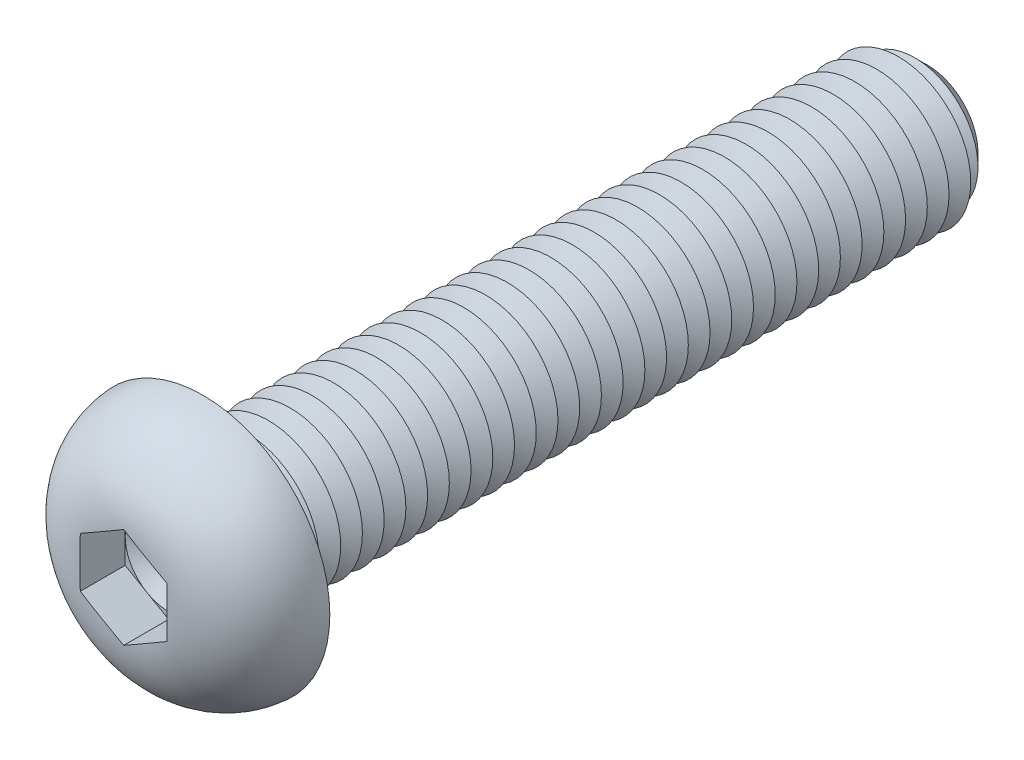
ISO-10303-21;
HEADER;
FILE_DESCRIPTION(('STEP AP214'),'2;1');
FILE_NAME('part.step','',(''),(''),'','','');
FILE_SCHEMA(('AUTOMOTIVE_DESIGN { 1 0 10303 214 1 1 1 1 }'));
ENDSEC;
DATA;
#1=APPLICATION_CONTEXT('core data for automotive mechanical design processes');
#2=APPLICATION_PROTOCOL_DEFINITION('international standard','automotive_design',2000,#1);
#3=PRODUCT_CONTEXT('',#1,'mechanical');
#4=PRODUCT('Part','Part','',(#3));
#5=PRODUCT_RELATED_PRODUCT_CATEGORY('part','',(#4));
#6=PRODUCT_DEFINITION_FORMATION('','',#4);
#7=PRODUCT_DEFINITION_CONTEXT('part definition',#1,'design');
#8=PRODUCT_DEFINITION('design','',#6,#7);
#9=PRODUCT_DEFINITION_SHAPE('','',#8);
#10=(LENGTH_UNIT() NAMED_UNIT(*) SI_UNIT(.MILLI.,.METRE.));
#11=(NAMED_UNIT(*) PLANE_ANGLE_UNIT() SI_UNIT($,.RADIAN.));
#12=(NAMED_UNIT(*) SI_UNIT($,.STERADIAN.) SOLID_ANGLE_UNIT());
#13=UNCERTAINTY_MEASURE_WITH_UNIT(LENGTH_MEASURE(1.E-05),#10,'distance_accuracy_value','');
#14=(GEOMETRIC_REPRESENTATION_CONTEXT(3) GLOBAL_UNCERTAINTY_ASSIGNED_CONTEXT((#13)) GLOBAL_UNIT_ASSIGNED_CONTEXT((#10,
#11,#12)) REPRESENTATION_CONTEXT('',''));
#15=CARTESIAN_POINT('',(0.,0.,0.));
#16=DIRECTION('',(0.,0.,1.));
#17=DIRECTION('',(1.,0.,0.));
#18=AXIS2_PLACEMENT_3D('',#15,#16,#17);
#19=CARTESIAN_POINT('',(0.,0.,2.38));
#20=DIRECTION('',(0.,0.,1.));
#21=DIRECTION('',(1.,0.,0.));
#22=AXIS2_PLACEMENT_3D('',#19,#20,#21);
#23=PLANE('',#22);
#24=CARTESIAN_POINT('',(0.,0.,2.38));
#25=DIRECTION('',(0.,0.,1.));
#26=DIRECTION('',(1.,0.,0.));
#27=AXIS2_PLACEMENT_3D('',#24,#25,#26);
#28=CIRCLE('',#27,3.);
#29=CARTESIAN_POINT('',(3.,0.,2.38));
#30=VERTEX_POINT('',#29);
#31=CARTESIAN_POINT('',(1.5,2.59807621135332,2.38));
#32=VERTEX_POINT('',#31);
#33=EDGE_CURVE('E117',#30,#32,#28,.T.);
#34=ORIENTED_EDGE('',*,*,#33,.F.);
#35=DIRECTION('',(0.,1.,0.));
#36=VECTOR('',#35,1.);
#37=CARTESIAN_POINT('',(3.,-1.73205080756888,2.38));
#38=LINE('',#37,#36);
#39=CARTESIAN_POINT('',(3.,1.73205080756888,2.38));
#40=VERTEX_POINT('',#39);
#41=EDGE_CURVE('E140',#30,#40,#38,.T.);
#42=ORIENTED_EDGE('',*,*,#41,.T.);
#43=DIRECTION('',(-0.866025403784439,0.5,0.));
#44=VECTOR('',#43,1.);
#45=CARTESIAN_POINT('',(3.,1.73205080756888,2.38));
#46=LINE('',#45,#44);
#47=EDGE_CURVE('E136',#40,#32,#46,.T.);
#48=ORIENTED_EDGE('',*,*,#47,.T.);
#49=EDGE_LOOP('',(#34,#42,#48));
#50=FACE_BOUND('',#49,.T.);
#51=ADVANCED_FACE('F39',(#50),#23,.T.);
#52=CARTESIAN_POINT('',(0.,0.,2.38));
#53=DIRECTION('',(0.,0.,1.));
#54=DIRECTION('',(1.,0.,0.));
#55=AXIS2_PLACEMENT_3D('',#52,#53,#54);
#56=CIRCLE('',#55,3.);
#57=CARTESIAN_POINT('',(-1.5,2.59807621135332,2.38));
#58=VERTEX_POINT('',#57);
#59=EDGE_CURVE('E11',#32,#58,#56,.T.);
#60=ORIENTED_EDGE('',*,*,#59,.F.);
#61=CARTESIAN_POINT('',(0.,3.46410161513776,2.38));
#62=VERTEX_POINT('',#61);
#63=EDGE_CURVE('E130',#32,#62,#46,.T.);
#64=ORIENTED_EDGE('',*,*,#63,.T.);
#65=DIRECTION('',(-0.866025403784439,-0.5,0.));
#66=VECTOR('',#65,1.);
#67=CARTESIAN_POINT('',(0.,3.46410161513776,2.38));
#68=LINE('',#67,#66);
#69=EDGE_CURVE('E131',#62,#58,#68,.T.);
#70=ORIENTED_EDGE('',*,*,#69,.T.);
#71=EDGE_LOOP('',(#60,#64,#70));
#72=FACE_BOUND('',#71,.T.);
#73=ADVANCED_FACE('F129',(#72),#23,.T.);
#74=CARTESIAN_POINT('',(-3.,0.,2.38));
#75=VERTEX_POINT('',#74);
#76=EDGE_CURVE('E49',#58,#75,#56,.T.);
#77=ORIENTED_EDGE('',*,*,#76,.F.);
#78=CARTESIAN_POINT('',(-3.,1.73205080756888,2.38));
#79=VERTEX_POINT('',#78);
#80=EDGE_CURVE('E143',#58,#79,#68,.T.);
#81=ORIENTED_EDGE('',*,*,#80,.T.);
#82=DIRECTION('',(0.,-1.,0.));
#83=VECTOR('',#82,1.);
#84=CARTESIAN_POINT('',(-3.,1.73205080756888,2.38));
#85=LINE('',#84,#83);
#86=EDGE_CURVE('E153',#79,#75,#85,.T.);
#87=ORIENTED_EDGE('',*,*,#86,.T.);
#88=EDGE_LOOP('',(#77,#81,#87));
#89=FACE_BOUND('',#88,.T.);
#90=ADVANCED_FACE('F277',(#89),#23,.T.);
#91=CARTESIAN_POINT('',(-1.5,-2.59807621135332,2.38));
#92=VERTEX_POINT('',#91);
#93=EDGE_CURVE('E258',#75,#92,#56,.T.);
#94=ORIENTED_EDGE('',*,*,#93,.F.);
#95=CARTESIAN_POINT('',(-3.,-1.73205080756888,2.38));
#96=VERTEX_POINT('',#95);
#97=EDGE_CURVE('E152',#75,#96,#85,.T.);
#98=ORIENTED_EDGE('',*,*,#97,.T.);
#99=DIRECTION('',(0.866025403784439,-0.5,0.));
#100=VECTOR('',#99,1.);
#101=CARTESIAN_POINT('',(-3.,-1.73205080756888,2.38));
#102=LINE('',#101,#100);
#103=EDGE_CURVE('E158',#96,#92,#102,.T.);
#104=ORIENTED_EDGE('',*,*,#103,.T.);
#105=EDGE_LOOP('',(#94,#98,#104));
#106=FACE_BOUND('',#105,.T.);
#107=ADVANCED_FACE('F271',(#106),#23,.T.);
#108=CARTESIAN_POINT('',(1.5,-2.59807621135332,2.38));
#109=VERTEX_POINT('',#108);
#110=EDGE_CURVE('E56',#92,#109,#56,.T.);
#111=ORIENTED_EDGE('',*,*,#110,.F.);
#112=CARTESIAN_POINT('',(0.,-3.46410161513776,2.38));
#113=VERTEX_POINT('',#112);
#114=EDGE_CURVE('E157',#92,#113,#102,.T.);
#115=ORIENTED_EDGE('',*,*,#114,.T.);
#116=DIRECTION('',(0.866025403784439,0.5,0.));
#117=VECTOR('',#116,1.);
#118=CARTESIAN_POINT('',(0.,-3.46410161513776,2.38));
#119=LINE('',#118,#117);
#120=EDGE_CURVE('E163',#113,#109,#119,.T.);
#121=ORIENTED_EDGE('',*,*,#120,.T.);
#122=EDGE_LOOP('',(#111,#115,#121));
#123=FACE_BOUND('',#122,.T.);
#124=ADVANCED_FACE('F314',(#123),#23,.T.);
#125=CARTESIAN_POINT('',(0.,0.,-50.));
#126=DIRECTION('',(0.,0.,1.));
#127=DIRECTION('',(1.,0.,0.));
#128=AXIS2_PLACEMENT_3D('',#125,#126,#127);
#129=CYLINDRICAL_SURFACE('',#128,5.);
#130=CARTESIAN_POINT('',(0.,0.,-0.600000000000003));
#131=DIRECTION('',(0.,0.,1.));
#132=DIRECTION('',(1.,0.,0.));
#133=AXIS2_PLACEMENT_3D('',#130,#131,#132);
#134=CIRCLE('',#133,5.);
#135=CARTESIAN_POINT('',(5.,0.,-0.600000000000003));
#136=VERTEX_POINT('',#135);
#137=EDGE_CURVE('E241',#136,#136,#134,.F.);
#138=ORIENTED_EDGE('',*,*,#137,.T.);
#139=EDGE_LOOP('',(#138));
#140=FACE_BOUND('',#139,.T.);
#141=CARTESIAN_POINT('',(0.,0.,-1.5));
#142=DIRECTION('',(0.,0.,1.));
#143=DIRECTION('',(1.,0.,0.));
#144=AXIS2_PLACEMENT_3D('',#141,#142,#143);
#145=CIRCLE('',#144,5.00000000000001);
#146=CARTESIAN_POINT('',(5.00000000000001,0.,-1.5));
#147=VERTEX_POINT('',#146);
#148=EDGE_CURVE('E138',#147,#147,#145,.T.);
#149=ORIENTED_EDGE('',*,*,#148,.T.);
#150=EDGE_LOOP('',(#149));
#151=FACE_BOUND('',#150,.T.);
#152=ADVANCED_FACE('F315',(#140,#151),#129,.T.);
#153=CARTESIAN_POINT('',(0.,8.75,0.));
#154=DIRECTION('',(0.,0.,1.));
#155=DIRECTION('',(1.,0.,0.));
#156=AXIS2_PLACEMENT_3D('',#153,#154,#155);
#157=PLANE('',#156);
#158=CARTESIAN_POINT('',(0.,0.,0.));
#159=DIRECTION('',(0.,0.,1.));
#160=DIRECTION('',(1.,0.,0.));
#161=AXIS2_PLACEMENT_3D('',#158,#159,#160);
#162=CIRCLE('',#161,5.6);
#163=CARTESIAN_POINT('',(5.6,0.,0.));
#164=VERTEX_POINT('',#163);
#165=EDGE_CURVE('E250',#164,#164,#162,.T.);
#166=ORIENTED_EDGE('',*,*,#165,.T.);
#167=EDGE_LOOP('',(#166));
#168=FACE_BOUND('',#167,.T.);
#169=CARTESIAN_POINT('',(0.,0.,0.));
#170=DIRECTION('',(0.,0.,1.));
#171=DIRECTION('',(1.,0.,0.));
#172=AXIS2_PLACEMENT_3D('',#169,#170,#171);
#173=CIRCLE('',#172,8.75);
#174=CARTESIAN_POINT('',(8.75,0.,0.));
#175=VERTEX_POINT('',#174);
#176=EDGE_CURVE('E174',#175,#175,#173,.T.);
#177=ORIENTED_EDGE('',*,*,#176,.F.);
#178=EDGE_LOOP('',(#177));
#179=FACE_BOUND('',#178,.T.);
#180=ADVANCED_FACE('F318',(#168,#179),#157,.F.);
#181=CARTESIAN_POINT('',(0.,0.,-0.3));
#182=DIRECTION('',(0.,0.,1.));
#183=DIRECTION('',(1.,0.,0.));
#184=AXIS2_PLACEMENT_3D('',#181,#182,#183);
#185=DEGENERATE_TOROIDAL_SURFACE('',#184,2.95776381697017,5.8,.T.);
#186=CARTESIAN_POINT('',(-3.0002,1.73193533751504,5.47784605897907));
#187=CARTESIAN_POINT('',(-2.87524340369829,1.80407906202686,5.4841525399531));
#188=CARTESIAN_POINT('',(-2.75023731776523,1.87625135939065,5.48853670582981));
#189=CARTESIAN_POINT('',(-2.5001955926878,2.02061301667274,5.49472046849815));
#190=CARTESIAN_POINT('',(-2.37515996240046,2.09280237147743,5.49652051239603));
#191=CARTESIAN_POINT('',(-2.12510741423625,2.23717027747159,5.4987972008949));
#192=CARTESIAN_POINT('',(-2.00009049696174,2.30934882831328,5.49927407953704));
#193=CARTESIAN_POINT('',(-1.75004905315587,2.45371032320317,5.49979859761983));
#194=CARTESIAN_POINT('',(-1.62502452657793,2.52589326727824,5.49984621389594));
#195=CARTESIAN_POINT('',(-1.37497547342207,2.67025915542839,5.49984621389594));
#196=CARTESIAN_POINT('',(-1.24995094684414,2.74244209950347,5.49979859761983));
#197=CARTESIAN_POINT('',(-0.999909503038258,2.88680359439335,5.49927407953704));
#198=CARTESIAN_POINT('',(-0.874892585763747,2.95898214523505,5.4987972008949));
#199=CARTESIAN_POINT('',(-0.624840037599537,3.10335005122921,5.49652051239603));
#200=CARTESIAN_POINT('',(-0.499804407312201,3.1755394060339,5.49472046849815));
#201=CARTESIAN_POINT('',(-0.249762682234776,3.31990106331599,5.48853670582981));
#202=CARTESIAN_POINT('',(-0.124756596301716,3.39207336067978,5.4841525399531));
#203=CARTESIAN_POINT('',(0.000199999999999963,3.46421708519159,5.47784605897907));
#204=B_SPLINE_CURVE_WITH_KNOTS('',3,(#186,#187,#188,#189,#190,#191,#192,#193,#194,#195,#196,
#197,#198,#199,#200,#201,#202,#203),.UNSPECIFIED.,.F.,.F.,(4,2,2,2,2,2,2,2,4),(0.,
0.433225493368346,0.866376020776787,1.29944992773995,1.73254720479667,2.16564448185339,
2.59871838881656,3.031868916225,3.46509440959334),.UNSPECIFIED.);
#205=CARTESIAN_POINT('',(-3.,1.73205080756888,5.4778561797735));
#206=VERTEX_POINT('',#205);
#207=CARTESIAN_POINT('',(0.,3.46410161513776,5.4778561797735));
#208=VERTEX_POINT('',#207);
#209=EDGE_CURVE('E196',#206,#208,#204,.T.);
#210=ORIENTED_EDGE('',*,*,#209,.T.);
#211=CARTESIAN_POINT('',(-0.000200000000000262,3.46421708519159,5.47784605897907));
#212=CARTESIAN_POINT('',(0.124756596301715,3.39207336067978,5.4841525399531));
#213=CARTESIAN_POINT('',(0.249762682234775,3.31990106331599,5.48853670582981));
#214=CARTESIAN_POINT('',(0.4998044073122,3.1755394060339,5.49472046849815));
#215=CARTESIAN_POINT('',(0.624840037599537,3.10335005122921,5.49652051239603));
#216=CARTESIAN_POINT('',(0.874892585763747,2.95898214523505,5.4987972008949));
#217=CARTESIAN_POINT('',(0.999909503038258,2.88680359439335,5.49927407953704));
#218=CARTESIAN_POINT('',(1.24995094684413,2.74244209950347,5.49979859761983));
#219=CARTESIAN_POINT('',(1.37497547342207,2.67025915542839,5.49984621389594));
#220=CARTESIAN_POINT('',(1.62502452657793,2.52589326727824,5.49984621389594));
#221=CARTESIAN_POINT('',(1.75004905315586,2.45371032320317,5.49979859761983));
#222=CARTESIAN_POINT('',(2.00009049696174,2.30934882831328,5.49927407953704));
#223=CARTESIAN_POINT('',(2.12510741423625,2.23717027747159,5.4987972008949));
#224=CARTESIAN_POINT('',(2.37515996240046,2.09280237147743,5.49652051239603));
#225=CARTESIAN_POINT('',(2.5001955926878,2.02061301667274,5.49472046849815));
#226=CARTESIAN_POINT('',(2.75023731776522,1.87625135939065,5.48853670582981));
#227=CARTESIAN_POINT('',(2.87524340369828,1.80407906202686,5.4841525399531));
#228=CARTESIAN_POINT('',(3.0002,1.73193533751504,5.47784605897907));
#229=B_SPLINE_CURVE_WITH_KNOTS('',3,(#211,#212,#213,#214,#215,#216,#217,#218,#219,#220,#221,
#222,#223,#224,#225,#226,#227,#228),.UNSPECIFIED.,.F.,.F.,(4,2,2,2,2,2,2,2,4),(0.,
0.433225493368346,0.866376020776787,1.29944992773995,1.73254720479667,2.16564448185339,
2.59871838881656,3.031868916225,3.46509440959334),.UNSPECIFIED.);
#230=CARTESIAN_POINT('',(3.,1.73205080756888,5.47785617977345));
#231=VERTEX_POINT('',#230);
#232=EDGE_CURVE('E225',#208,#231,#229,.T.);
#233=ORIENTED_EDGE('',*,*,#232,.T.);
#234=CARTESIAN_POINT('',(3.,0.,5.49984621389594));
#235=CARTESIAN_POINT('',(3.,-0.125570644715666,5.49984449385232));
#236=CARTESIAN_POINT('',(3.,-0.251141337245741,5.49980426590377));
#237=CARTESIAN_POINT('',(3.,-0.502283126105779,5.499449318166));
#238=CARTESIAN_POINT('',(3.,-0.62785422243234,5.49913459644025));
#239=CARTESIAN_POINT('',(3.,-0.879037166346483,5.49770394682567));
#240=CARTESIAN_POINT('',(3.,-1.00464901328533,5.49658774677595));
#241=CARTESIAN_POINT('',(3.,-1.2558477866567,5.49279605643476));
#242=CARTESIAN_POINT('',(3.,-1.38143471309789,5.49012056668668));
#243=CARTESIAN_POINT('',(3.,-1.7568847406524,5.47847778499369));
#244=CARTESIAN_POINT('',(3.,-2.00667103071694,5.46590367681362));
#245=CARTESIAN_POINT('',(3.,-2.50488375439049,5.42441448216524));
#246=CARTESIAN_POINT('',(3.,-2.75331093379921,5.3955095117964));
#247=CARTESIAN_POINT('',(3.,-3.18719021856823,5.32582626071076));
#248=CARTESIAN_POINT('',(3.,-3.3733635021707,5.28960049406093));
#249=CARTESIAN_POINT('',(3.,-3.74245496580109,5.20330651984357));
#250=CARTESIAN_POINT('',(3.,-3.92537417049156,5.15324275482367));
#251=CARTESIAN_POINT('',(3.,-4.28675502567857,5.03819885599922));
#252=CARTESIAN_POINT('',(3.,-4.46521058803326,4.97319946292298));
#253=CARTESIAN_POINT('',(3.,-4.81576789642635,4.82782766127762));
#254=CARTESIAN_POINT('',(3.,-4.98786985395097,4.74745576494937));
#255=CARTESIAN_POINT('',(3.,-5.3254008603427,4.5705398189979));
#256=CARTESIAN_POINT('',(3.,-5.49076268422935,4.47386710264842));
#257=CARTESIAN_POINT('',(3.,-5.81151175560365,4.26514040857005));
#258=CARTESIAN_POINT('',(3.,-5.96689840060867,4.15308550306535));
#259=CARTESIAN_POINT('',(3.,-6.26591787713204,3.91428862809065));
#260=CARTESIAN_POINT('',(3.,-6.40955257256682,3.78754899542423));
#261=CARTESIAN_POINT('',(3.,-6.68342295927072,3.52034797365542));
#262=CARTESIAN_POINT('',(3.,-6.81366070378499,3.3798886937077));
#263=CARTESIAN_POINT('',(3.,-7.0426666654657,3.10626157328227));
#264=CARTESIAN_POINT('',(3.,-7.1433109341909,2.97465879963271));
#265=CARTESIAN_POINT('',(3.,-7.33253056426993,2.70304716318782));
#266=CARTESIAN_POINT('',(3.,-7.42110686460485,2.56303895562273));
#267=CARTESIAN_POINT('',(3.,-7.58534868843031,2.27573732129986));
#268=CARTESIAN_POINT('',(3.,-7.66102067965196,2.12844759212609));
#269=CARTESIAN_POINT('',(3.,-7.79881901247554,1.82765987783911));
#270=CARTESIAN_POINT('',(3.,-7.86094563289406,1.67416202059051));
#271=CARTESIAN_POINT('',(3.,-7.96803488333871,1.37082076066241));
#272=CARTESIAN_POINT('',(3.,-8.01375687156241,1.22124490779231));
#273=CARTESIAN_POINT('',(3.,-8.09224398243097,0.918674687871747));
#274=CARTESIAN_POINT('',(3.,-8.12500479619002,0.765679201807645));
#275=CARTESIAN_POINT('',(3.,-8.17726457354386,0.457507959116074));
#276=CARTESIAN_POINT('',(3.,-8.1967692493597,0.302333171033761));
#277=CARTESIAN_POINT('',(3.,-8.22238322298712,-0.00917738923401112));
#278=CARTESIAN_POINT('',(3.,-8.22848754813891,-0.165513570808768));
#279=CARTESIAN_POINT('',(3.,-8.22724693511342,-0.475358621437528));
#280=CARTESIAN_POINT('',(3.,-8.2201384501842,-0.628868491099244));
#281=CARTESIAN_POINT('',(3.,-8.1929851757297,-0.934809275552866));
#282=CARTESIAN_POINT('',(3.,-8.17293462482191,-1.0872396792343));
#283=CARTESIAN_POINT('',(3.,-8.1200547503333,-1.38984943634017));
#284=CARTESIAN_POINT('',(3.,-8.08722683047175,-1.54002903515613));
#285=CARTESIAN_POINT('',(3.,-8.0090712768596,-1.83702738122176));
#286=CARTESIAN_POINT('',(3.,-7.96374919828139,-1.98384759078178));
#287=CARTESIAN_POINT('',(3.,-7.86096457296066,-2.27315566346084));
#288=CARTESIAN_POINT('',(3.,-7.80350334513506,-2.41564399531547));
#289=CARTESIAN_POINT('',(3.,-7.67691451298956,-2.6952770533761));
#290=CARTESIAN_POINT('',(3.,-7.60779108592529,-2.83242367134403));
#291=CARTESIAN_POINT('',(3.,-7.45837210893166,-3.10056990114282));
#292=CARTESIAN_POINT('',(3.,-7.37807144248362,-3.23156666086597));
#293=CARTESIAN_POINT('',(3.,-7.20697634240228,-3.48645411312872));
#294=CARTESIAN_POINT('',(3.,-7.11618520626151,-3.61034702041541));
#295=CARTESIAN_POINT('',(3.,-6.92334779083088,-3.85210954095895));
#296=CARTESIAN_POINT('',(3.,-6.82115263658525,-3.96986038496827));
#297=CARTESIAN_POINT('',(3.,-6.60745266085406,-4.19658717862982));
#298=CARTESIAN_POINT('',(3.,-6.49594754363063,-4.30556284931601));
#299=CARTESIAN_POINT('',(3.,-6.26450055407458,-4.51413072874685));
#300=CARTESIAN_POINT('',(3.,-6.14455919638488,-4.61372350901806));
#301=CARTESIAN_POINT('',(3.,-5.8971402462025,-4.80306090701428));
#302=CARTESIAN_POINT('',(3.,-5.76966228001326,-4.89280503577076));
#303=CARTESIAN_POINT('',(3.,-5.50268934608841,-5.06561354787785));
#304=CARTESIAN_POINT('',(3.,-5.36291526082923,-5.14824654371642));
#305=CARTESIAN_POINT('',(3.,-5.07726499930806,-5.30226841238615));
#306=CARTESIAN_POINT('',(3.,-4.93138704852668,-5.37365398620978));
#307=CARTESIAN_POINT('',(3.,-4.63484455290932,-5.50505544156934));
#308=CARTESIAN_POINT('',(3.,-4.48418671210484,-5.56508649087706));
#309=CARTESIAN_POINT('',(3.,-4.17906596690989,-5.6740700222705));
#310=CARTESIAN_POINT('',(3.,-4.02460600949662,-5.72303080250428));
#311=CARTESIAN_POINT('',(3.,-3.6739247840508,-5.82125760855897));
#312=CARTESIAN_POINT('',(3.,-3.47687521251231,-5.86756841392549));
#313=CARTESIAN_POINT('',(3.,-3.07981530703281,-5.94521593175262));
#314=CARTESIAN_POINT('',(3.,-2.87980357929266,-5.97654534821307));
#315=CARTESIAN_POINT('',(3.,-2.47751859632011,-6.02656554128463));
#316=CARTESIAN_POINT('',(3.,-2.27523974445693,-6.0452096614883));
#317=CARTESIAN_POINT('',(3.,-1.8700786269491,-6.07274849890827));
#318=CARTESIAN_POINT('',(3.,-1.66719636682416,-6.08164330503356));
#319=CARTESIAN_POINT('',(3.,-1.25887867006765,-6.09343726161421));
#320=CARTESIAN_POINT('',(3.,-1.05344157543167,-6.09626381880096));
#321=CARTESIAN_POINT('',(3.,-0.745285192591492,-6.0985660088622));
#322=CARTESIAN_POINT('',(3.,-0.642567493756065,-6.09901047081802));
#323=CARTESIAN_POINT('',(3.,-0.437131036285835,-6.09957976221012));
#324=CARTESIAN_POINT('',(3.,-0.334412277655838,-6.09970459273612));
#325=CARTESIAN_POINT('',(3.,-0.129132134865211,-6.09984385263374));
#326=CARTESIAN_POINT('',(3.,-0.0265707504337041,-6.09985845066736));
#327=CARTESIAN_POINT('',(3.,0.178552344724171,-6.09981980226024));
#328=CARTESIAN_POINT('',(3.,0.281114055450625,-6.09976655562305));
#329=CARTESIAN_POINT('',(3.,0.486235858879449,-6.09946703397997));
#330=CARTESIAN_POINT('',(3.,0.588795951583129,-6.0992207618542));
#331=CARTESIAN_POINT('',(3.,0.793913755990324,-6.09826017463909));
#332=CARTESIAN_POINT('',(3.,0.896471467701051,-6.097545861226));
#333=CARTESIAN_POINT('',(3.,1.11088851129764,-6.0951586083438));
#334=CARTESIAN_POINT('',(3.,1.22274716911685,-6.0934045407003));
#335=CARTESIAN_POINT('',(3.,1.44642575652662,-6.08829151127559));
#336=CARTESIAN_POINT('',(3.,1.55824568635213,-6.08493255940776));
#337=CARTESIAN_POINT('',(3.,1.89360474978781,-6.07150074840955));
#338=CARTESIAN_POINT('',(3.,2.11703989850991,-6.05807293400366));
#339=CARTESIAN_POINT('',(3.,2.56083256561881,-6.01778675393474));
#340=CARTESIAN_POINT('',(3.,2.78120000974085,-5.99104517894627));
#341=CARTESIAN_POINT('',(3.,3.2192866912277,-5.92065658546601));
#342=CARTESIAN_POINT('',(3.,3.43700630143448,-5.8770119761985));
#343=CARTESIAN_POINT('',(3.,3.82666678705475,-5.78060449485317));
#344=CARTESIAN_POINT('',(3.,3.99942726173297,-5.73116262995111));
#345=CARTESIAN_POINT('',(3.,4.3405567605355,-5.61888897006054));
#346=CARTESIAN_POINT('',(3.,4.50892617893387,-5.55605838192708));
#347=CARTESIAN_POINT('',(3.,4.84049143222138,-5.41635874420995));
#348=CARTESIAN_POINT('',(3.,5.00366586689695,-5.33943871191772));
#349=CARTESIAN_POINT('',(3.,5.32271829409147,-5.17167128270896));
#350=CARTESIAN_POINT('',(3.,5.47859600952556,-5.0808233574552));
#351=CARTESIAN_POINT('',(3.,5.7822829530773,-4.88500135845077));
#352=CARTESIAN_POINT('',(3.,5.93005015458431,-4.77996197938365));
#353=CARTESIAN_POINT('',(3.,6.21523046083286,-4.55663689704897));
#354=CARTESIAN_POINT('',(3.,6.35264336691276,-4.43835093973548));
#355=CARTESIAN_POINT('',(3.,6.61552762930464,-4.18948618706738));
#356=CARTESIAN_POINT('',(3.,6.74101380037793,-4.05892305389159));
#357=CARTESIAN_POINT('',(3.,6.97891308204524,-3.78639059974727));
#358=CARTESIAN_POINT('',(3.,7.09132750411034,-3.64442242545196));
#359=CARTESIAN_POINT('',(3.,7.29113623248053,-3.36530209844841));
#360=CARTESIAN_POINT('',(3.,7.37991316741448,-3.22913733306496));
#361=CARTESIAN_POINT('',(3.,7.5451968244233,-2.94955428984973));
#362=CARTESIAN_POINT('',(3.,7.62170419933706,-2.80613639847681));
#363=CARTESIAN_POINT('',(3.,7.76177641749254,-2.5131168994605));
#364=CARTESIAN_POINT('',(3.,7.82534152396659,-2.36351541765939));
#365=CARTESIAN_POINT('',(3.,7.93897019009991,-2.05926799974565));
#366=CARTESIAN_POINT('',(3.,7.98903395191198,-1.9046221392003));
#367=CARTESIAN_POINT('',(3.,8.07336540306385,-1.59821781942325));
#368=CARTESIAN_POINT('',(3.,8.10821878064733,-1.44662026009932));
#369=CARTESIAN_POINT('',(3.,8.16487862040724,-1.14095089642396));
#370=CARTESIAN_POINT('',(3.,8.18668070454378,-0.986878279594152));
#371=CARTESIAN_POINT('',(3.,8.21703234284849,-0.677515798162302));
#372=CARTESIAN_POINT('',(3.,8.22558889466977,-0.522226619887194));
#373=CARTESIAN_POINT('',(3.,8.22940229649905,-0.211427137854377));
#374=CARTESIAN_POINT('',(3.,8.22465425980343,-0.0559167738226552));
#375=CARTESIAN_POINT('',(3.,8.20204101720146,0.252033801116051));
#376=CARTESIAN_POINT('',(3.,8.18435378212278,0.404487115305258));
#377=CARTESIAN_POINT('',(3.,8.136196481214,0.707418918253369));
#378=CARTESIAN_POINT('',(3.,8.1057217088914,0.857896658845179));
#379=CARTESIAN_POINT('',(3.,8.03224632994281,1.15569567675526));
#380=CARTESIAN_POINT('',(3.,7.9892508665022,1.30301822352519));
#381=CARTESIAN_POINT('',(3.,7.89104818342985,1.59360769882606));
#382=CARTESIAN_POINT('',(3.,7.83583549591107,1.73687277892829));
#383=CARTESIAN_POINT('',(3.,7.71349498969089,2.01864020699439));
#384=CARTESIAN_POINT('',(3.,7.64633814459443,2.1571299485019));
#385=CARTESIAN_POINT('',(3.,7.50076383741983,2.42797950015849));
#386=CARTESIAN_POINT('',(3.,7.42235122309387,2.56034191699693));
#387=CARTESIAN_POINT('',(3.,7.25483284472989,2.8181715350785));
#388=CARTESIAN_POINT('',(3.,7.16572386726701,2.94363664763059));
#389=CARTESIAN_POINT('',(3.,6.9775559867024,3.1867979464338));
#390=CARTESIAN_POINT('',(3.,6.87850037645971,3.30449668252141));
#391=CARTESIAN_POINT('',(3.,6.66919743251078,3.53363644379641));
#392=CARTESIAN_POINT('',(3.,6.55877281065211,3.6449154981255));
#393=CARTESIAN_POINT('',(3.,6.32925753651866,3.85806320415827));
#394=CARTESIAN_POINT('',(3.,6.21016952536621,3.95993470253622));
#395=CARTESIAN_POINT('',(3.,5.96413069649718,4.15386505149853));
#396=CARTESIAN_POINT('',(3.,5.83717459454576,4.24591719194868));
#397=CARTESIAN_POINT('',(3.,5.5764653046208,4.41973423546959));
#398=CARTESIAN_POINT('',(3.,5.4427139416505,4.50150188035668));
#399=CARTESIAN_POINT('',(3.,5.16249709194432,4.65840017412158));
#400=CARTESIAN_POINT('',(3.,5.01573037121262,4.73299250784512));
#401=CARTESIAN_POINT('',(3.,4.71685583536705,4.87057528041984));
#402=CARTESIAN_POINT('',(3.,4.56474751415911,4.93356461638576));
#403=CARTESIAN_POINT('',(3.,4.25657035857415,5.04801407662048));
#404=CARTESIAN_POINT('',(3.,4.10050882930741,5.09949395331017));
#405=CARTESIAN_POINT('',(3.,3.78523286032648,5.19149003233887));
#406=CARTESIAN_POINT('',(3.,3.62601895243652,5.23200806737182));
#407=CARTESIAN_POINT('',(3.,3.32461902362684,5.29856444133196));
#408=CARTESIAN_POINT('',(3.,3.18268434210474,5.32575733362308));
#409=CARTESIAN_POINT('',(3.,2.89760844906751,5.3729307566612));
#410=CARTESIAN_POINT('',(3.,2.75446703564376,5.39291005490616));
#411=CARTESIAN_POINT('',(3.,2.46730946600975,5.42656527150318));
#412=CARTESIAN_POINT('',(3.,2.32329255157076,5.44023457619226));
#413=CARTESIAN_POINT('',(3.,2.03487642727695,5.46234228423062));
#414=CARTESIAN_POINT('',(3.,1.89047722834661,5.4707808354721));
#415=CARTESIAN_POINT('',(3.,1.60058090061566,5.48373897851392));
#416=CARTESIAN_POINT('',(3.,1.45508270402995,5.48823290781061));
#417=CARTESIAN_POINT('',(3.,1.16402671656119,5.49458098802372));
#418=CARTESIAN_POINT('',(3.,1.01846892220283,5.49643495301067));
#419=CARTESIAN_POINT('',(3.,0.72742451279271,5.49877506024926));
#420=CARTESIAN_POINT('',(3.,0.581937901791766,5.49926194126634));
#421=CARTESIAN_POINT('',(3.,0.290967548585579,5.49979850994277));
#422=CARTESIAN_POINT('',(3.,0.145483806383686,5.49984820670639));
#423=CARTESIAN_POINT('',(3.,0.,5.49984621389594));
#424=B_SPLINE_CURVE_WITH_KNOTS('',3,(#234,#235,#236,#237,#238,#239,#240,#241,#242,#243,#244,
#245,#246,#247,#248,#249,#250,#251,#252,#253,#254,#255,#256,#257,#258,#259,#260,#261,#262,#263,
#264,#265,#266,#267,#268,#269,#270,#271,#272,#273,#274,#275,#276,#277,#278,#279,#280,#281,#282,
#283,#284,#285,#286,#287,#288,#289,#290,#291,#292,#293,#294,#295,#296,#297,#298,#299,#300,#301,
#302,#303,#304,#305,#306,#307,#308,#309,#310,#311,#312,#313,#314,#315,#316,#317,#318,#319,#320,
#321,#322,#323,#324,#325,#326,#327,#328,#329,#330,#331,#332,#333,#334,#335,#336,#337,#338,#339,
#340,#341,#342,#343,#344,#345,#346,#347,#348,#349,#350,#351,#352,#353,#354,#355,#356,#357,#358,
#359,#360,#361,#362,#363,#364,#365,#366,#367,#368,#369,#370,#371,#372,#373,#374,#375,#376,#377,
#378,#379,#380,#381,#382,#383,#384,#385,#386,#387,#388,#389,#390,#391,#392,#393,#394,#395,#396,
#397,#398,#399,#400,#401,#402,#403,#404,#405,#406,#407,#408,#409,#410,#411,#412,#413,#414,#415,
#416,#417,#418,#419,#420,#421,#422,#423),.UNSPECIFIED.,.T.,.F.,(4,2,2,2,2,2,2,2,2,2,2,2,2,2,2,2,
2,2,2,2,2,2,2,2,2,2,2,2,2,2,2,2,2,2,2,2,2,2,2,2,2,2,2,2,2,2,2,2,2,2,2,2,2,2,2,2,2,2,2,2,2,2,2,2,
2,2,2,2,2,2,2,2,2,2,2,2,2,2,2,2,2,2,2,2,2,2,2,2,2,2,2,2,2,2,4),(0.,0.376711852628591,
0.753426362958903,1.13026885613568,1.50711121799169,2.257095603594,3.00661592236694,
3.57514719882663,4.14349616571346,4.71258216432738,5.28164920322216,5.85543852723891,
6.42926247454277,7.00299523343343,7.57663992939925,8.07303876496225,8.56939895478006,
9.06550962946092,9.56161009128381,10.030267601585,10.4990807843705,10.9676918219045,
11.4364767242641,11.8969530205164,12.3576344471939,12.8182652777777,13.2786916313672,
13.7390679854,14.1992797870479,14.6597029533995,15.1199817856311,15.5871904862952,
16.0544140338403,16.5216091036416,16.9888273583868,17.4754224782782,17.9621600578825,
18.4482427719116,18.9339599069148,19.5405320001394,20.1473991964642,20.7564865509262,
21.3655683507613,21.9818967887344,22.2900536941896,22.5982095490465,22.905893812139,
23.2135789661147,23.5212595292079,23.8289389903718,24.1645461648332,24.5001512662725,
25.171371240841,25.8368042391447,26.5021424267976,27.0407309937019,27.5792710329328,
28.119799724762,28.660348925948,29.2034761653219,29.7466138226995,30.2890677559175,
30.831467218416,31.3185063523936,31.8055195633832,32.2925228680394,32.779518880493,
33.2456153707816,33.7118681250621,34.1778744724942,34.6440520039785,35.103935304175,
35.563988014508,36.0238520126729,36.4839222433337,36.9451261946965,37.4061321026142,
37.8672768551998,38.3282694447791,38.7980460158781,39.2676799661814,39.7376328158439,
40.207460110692,40.7008436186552,41.1942739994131,41.6868509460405,42.1793454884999,
42.6126940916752,43.0461167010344,43.479992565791,43.9138561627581,44.3505218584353,
44.7872183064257,45.2236787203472,45.6601300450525),.UNSPECIFIED.);
#425=CARTESIAN_POINT('',(3.,-1.73205080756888,5.4778561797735));
#426=VERTEX_POINT('',#425);
#427=EDGE_CURVE('E234',#231,#426,#424,.T.);
#428=ORIENTED_EDGE('',*,*,#427,.T.);
#429=CARTESIAN_POINT('',(3.0002,-1.73193533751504,5.47784605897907));
#430=CARTESIAN_POINT('',(2.87524340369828,-1.80407906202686,5.4841525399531));
#431=CARTESIAN_POINT('',(2.75023731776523,-1.87625135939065,5.48853670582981));
#432=CARTESIAN_POINT('',(2.5001955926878,-2.02061301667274,5.49472046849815));
#433=CARTESIAN_POINT('',(2.37515996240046,-2.09280237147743,5.49652051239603));
#434=CARTESIAN_POINT('',(2.12510741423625,-2.23717027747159,5.4987972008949));
#435=CARTESIAN_POINT('',(2.00009049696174,-2.30934882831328,5.49927407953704));
#436=CARTESIAN_POINT('',(1.75004905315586,-2.45371032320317,5.49979859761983));
#437=CARTESIAN_POINT('',(1.62502452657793,-2.52589326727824,5.49984621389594));
#438=CARTESIAN_POINT('',(1.37497547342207,-2.67025915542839,5.49984621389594));
#439=CARTESIAN_POINT('',(1.24995094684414,-2.74244209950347,5.49979859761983));
#440=CARTESIAN_POINT('',(0.999909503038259,-2.88680359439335,5.49927407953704));
#441=CARTESIAN_POINT('',(0.874892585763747,-2.95898214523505,5.4987972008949));
#442=CARTESIAN_POINT('',(0.624840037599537,-3.10335005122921,5.49652051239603));
#443=CARTESIAN_POINT('',(0.499804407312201,-3.1755394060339,5.49472046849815));
#444=CARTESIAN_POINT('',(0.249762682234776,-3.31990106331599,5.48853670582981));
#445=CARTESIAN_POINT('',(0.124756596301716,-3.39207336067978,5.4841525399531));
#446=CARTESIAN_POINT('',(-0.000199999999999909,-3.46421708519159,5.47784605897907));
#447=B_SPLINE_CURVE_WITH_KNOTS('',3,(#429,#430,#431,#432,#433,#434,#435,#436,#437,#438,#439,
#440,#441,#442,#443,#444,#445,#446),.UNSPECIFIED.,.F.,.F.,(4,2,2,2,2,2,2,2,4),(0.,
0.433225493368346,0.866376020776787,1.29944992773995,1.73254720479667,2.16564448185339,
2.59871838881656,3.031868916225,3.46509440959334),.UNSPECIFIED.);
#448=CARTESIAN_POINT('',(0.,-3.46410161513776,5.4778561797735));
#449=VERTEX_POINT('',#448);
#450=EDGE_CURVE('E288',#426,#449,#447,.T.);
#451=ORIENTED_EDGE('',*,*,#450,.T.);
#452=CARTESIAN_POINT('',(0.000200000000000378,-3.46421708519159,5.47784605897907));
#453=CARTESIAN_POINT('',(-0.124756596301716,-3.39207336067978,5.4841525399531));
#454=CARTESIAN_POINT('',(-0.249762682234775,-3.31990106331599,5.48853670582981));
#455=CARTESIAN_POINT('',(-0.499804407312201,-3.1755394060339,5.49472046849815));
#456=CARTESIAN_POINT('',(-0.624840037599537,-3.10335005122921,5.49652051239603));
#457=CARTESIAN_POINT('',(-0.874892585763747,-2.95898214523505,5.4987972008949));
#458=CARTESIAN_POINT('',(-0.999909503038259,-2.88680359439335,5.49927407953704));
#459=CARTESIAN_POINT('',(-1.24995094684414,-2.74244209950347,5.49979859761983));
#460=CARTESIAN_POINT('',(-1.37497547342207,-2.67025915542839,5.49984621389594));
#461=CARTESIAN_POINT('',(-1.62502452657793,-2.52589326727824,5.49984621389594));
#462=CARTESIAN_POINT('',(-1.75004905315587,-2.45371032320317,5.49979859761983));
#463=CARTESIAN_POINT('',(-2.00009049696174,-2.30934882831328,5.49927407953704));
#464=CARTESIAN_POINT('',(-2.12510741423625,-2.23717027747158,5.4987972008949));
#465=CARTESIAN_POINT('',(-2.37515996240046,-2.09280237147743,5.49652051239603));
#466=CARTESIAN_POINT('',(-2.5001955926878,-2.02061301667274,5.49472046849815));
#467=CARTESIAN_POINT('',(-2.75023731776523,-1.87625135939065,5.48853670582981));
#468=CARTESIAN_POINT('',(-2.87524340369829,-1.80407906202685,5.4841525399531));
#469=CARTESIAN_POINT('',(-3.0002,-1.73193533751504,5.47784605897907));
#470=B_SPLINE_CURVE_WITH_KNOTS('',3,(#452,#453,#454,#455,#456,#457,#458,#459,#460,#461,#462,
#463,#464,#465,#466,#467,#468,#469),.UNSPECIFIED.,.F.,.F.,(4,2,2,2,2,2,2,2,4),(0.,
0.433225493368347,0.866376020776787,1.29944992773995,1.73254720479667,2.16564448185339,
2.59871838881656,3.031868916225,3.46509440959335),.UNSPECIFIED.);
#471=CARTESIAN_POINT('',(-3.,-1.73205080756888,5.47785617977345));
#472=VERTEX_POINT('',#471);
#473=EDGE_CURVE('E284',#449,#472,#470,.T.);
#474=ORIENTED_EDGE('',*,*,#473,.T.);
#475=CARTESIAN_POINT('',(-3.,0.,5.49984621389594));
#476=CARTESIAN_POINT('',(-3.,0.125570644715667,5.49984449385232));
#477=CARTESIAN_POINT('',(-3.,0.251141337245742,5.49980426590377));
#478=CARTESIAN_POINT('',(-3.,0.50228312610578,5.499449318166));
#479=CARTESIAN_POINT('',(-3.,0.627854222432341,5.49913459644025));
#480=CARTESIAN_POINT('',(-3.,0.879037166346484,5.49770394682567));
#481=CARTESIAN_POINT('',(-3.,1.00464901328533,5.49658774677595));
#482=CARTESIAN_POINT('',(-3.,1.2558477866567,5.49279605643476));
#483=CARTESIAN_POINT('',(-3.,1.3814347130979,5.49012056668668));
#484=CARTESIAN_POINT('',(-3.,1.7568847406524,5.47847778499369));
#485=CARTESIAN_POINT('',(-3.,2.00667103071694,5.46590367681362));
#486=CARTESIAN_POINT('',(-3.,2.50488375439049,5.42441448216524));
#487=CARTESIAN_POINT('',(-3.,2.75331093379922,5.3955095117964));
#488=CARTESIAN_POINT('',(-3.,3.18719021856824,5.32582626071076));
#489=CARTESIAN_POINT('',(-3.,3.3733635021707,5.28960049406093));
#490=CARTESIAN_POINT('',(-3.,3.74245496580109,5.20330651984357));
#491=CARTESIAN_POINT('',(-3.,3.92537417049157,5.15324275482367));
#492=CARTESIAN_POINT('',(-3.,4.28675502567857,5.03819885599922));
#493=CARTESIAN_POINT('',(-3.,4.46521058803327,4.97319946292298));
#494=CARTESIAN_POINT('',(-3.,4.81576789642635,4.82782766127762));
#495=CARTESIAN_POINT('',(-3.,4.98786985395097,4.74745576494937));
#496=CARTESIAN_POINT('',(-3.,5.3254008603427,4.5705398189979));
#497=CARTESIAN_POINT('',(-3.,5.49076268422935,4.47386710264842));
#498=CARTESIAN_POINT('',(-3.,5.81151175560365,4.26514040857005));
#499=CARTESIAN_POINT('',(-3.,5.96689840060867,4.15308550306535));
#500=CARTESIAN_POINT('',(-3.,6.26591787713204,3.91428862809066));
#501=CARTESIAN_POINT('',(-3.,6.40955257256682,3.78754899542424));
#502=CARTESIAN_POINT('',(-3.,6.68342295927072,3.52034797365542));
#503=CARTESIAN_POINT('',(-3.,6.81366070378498,3.3798886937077));
#504=CARTESIAN_POINT('',(-3.,7.0426666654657,3.10626157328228));
#505=CARTESIAN_POINT('',(-3.,7.14331093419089,2.97465879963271));
#506=CARTESIAN_POINT('',(-3.,7.33253056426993,2.70304716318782));
#507=CARTESIAN_POINT('',(-3.,7.42110686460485,2.56303895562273));
#508=CARTESIAN_POINT('',(-3.,7.58534868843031,2.27573732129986));
#509=CARTESIAN_POINT('',(-3.,7.66102067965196,2.12844759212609));
#510=CARTESIAN_POINT('',(-3.,7.79881901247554,1.82765987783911));
#511=CARTESIAN_POINT('',(-3.,7.86094563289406,1.67416202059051));
#512=CARTESIAN_POINT('',(-3.,7.96803488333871,1.37082076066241));
#513=CARTESIAN_POINT('',(-3.,8.01375687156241,1.22124490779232));
#514=CARTESIAN_POINT('',(-3.,8.09224398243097,0.918674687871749));
#515=CARTESIAN_POINT('',(-3.,8.12500479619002,0.765679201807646));
#516=CARTESIAN_POINT('',(-3.,8.17726457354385,0.457507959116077));
#517=CARTESIAN_POINT('',(-3.,8.1967692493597,0.302333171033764));
#518=CARTESIAN_POINT('',(-3.,8.22238322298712,-0.00917738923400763));
#519=CARTESIAN_POINT('',(-3.,8.22848754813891,-0.165513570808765));
#520=CARTESIAN_POINT('',(-3.,8.22724693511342,-0.475358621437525));
#521=CARTESIAN_POINT('',(-3.,8.2201384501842,-0.628868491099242));
#522=CARTESIAN_POINT('',(-3.,8.1929851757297,-0.934809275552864));
#523=CARTESIAN_POINT('',(-3.,8.17293462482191,-1.08723967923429));
#524=CARTESIAN_POINT('',(-3.,8.1200547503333,-1.38984943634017));
#525=CARTESIAN_POINT('',(-3.,8.08722683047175,-1.54002903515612));
#526=CARTESIAN_POINT('',(-3.,8.0090712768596,-1.83702738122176));
#527=CARTESIAN_POINT('',(-3.,7.96374919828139,-1.98384759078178));
#528=CARTESIAN_POINT('',(-3.,7.86096457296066,-2.27315566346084));
#529=CARTESIAN_POINT('',(-3.,7.80350334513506,-2.41564399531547));
#530=CARTESIAN_POINT('',(-3.,7.67691451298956,-2.69527705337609));
#531=CARTESIAN_POINT('',(-3.,7.60779108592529,-2.83242367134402));
#532=CARTESIAN_POINT('',(-3.,7.45837210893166,-3.10056990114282));
#533=CARTESIAN_POINT('',(-3.,7.37807144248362,-3.23156666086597));
#534=CARTESIAN_POINT('',(-3.,7.20697634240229,-3.48645411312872));
#535=CARTESIAN_POINT('',(-3.,7.11618520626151,-3.61034702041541));
#536=CARTESIAN_POINT('',(-3.,6.92334779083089,-3.85210954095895));
#537=CARTESIAN_POINT('',(-3.,6.82115263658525,-3.96986038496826));
#538=CARTESIAN_POINT('',(-3.,6.60745266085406,-4.19658717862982));
#539=CARTESIAN_POINT('',(-3.,6.49594754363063,-4.30556284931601));
#540=CARTESIAN_POINT('',(-3.,6.26450055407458,-4.51413072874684));
#541=CARTESIAN_POINT('',(-3.,6.14455919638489,-4.61372350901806));
#542=CARTESIAN_POINT('',(-3.,5.8971402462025,-4.80306090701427));
#543=CARTESIAN_POINT('',(-3.,5.76966228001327,-4.89280503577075));
#544=CARTESIAN_POINT('',(-3.,5.50268934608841,-5.06561354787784));
#545=CARTESIAN_POINT('',(-3.,5.36291526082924,-5.14824654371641));
#546=CARTESIAN_POINT('',(-3.,5.07726499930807,-5.30226841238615));
#547=CARTESIAN_POINT('',(-3.,4.93138704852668,-5.37365398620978));
#548=CARTESIAN_POINT('',(-3.,4.63484455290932,-5.50505544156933));
#549=CARTESIAN_POINT('',(-3.,4.48418671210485,-5.56508649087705));
#550=CARTESIAN_POINT('',(-3.,4.17906596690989,-5.6740700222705));
#551=CARTESIAN_POINT('',(-3.,4.02460600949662,-5.72303080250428));
#552=CARTESIAN_POINT('',(-3.,3.6739247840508,-5.82125760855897));
#553=CARTESIAN_POINT('',(-3.,3.47687521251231,-5.86756841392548));
#554=CARTESIAN_POINT('',(-3.,3.07981530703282,-5.94521593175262));
#555=CARTESIAN_POINT('',(-3.,2.87980357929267,-5.97654534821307));
#556=CARTESIAN_POINT('',(-3.,2.47751859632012,-6.02656554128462));
#557=CARTESIAN_POINT('',(-3.,2.27523974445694,-6.0452096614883));
#558=CARTESIAN_POINT('',(-3.,1.87007862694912,-6.07274849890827));
#559=CARTESIAN_POINT('',(-3.,1.66719636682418,-6.08164330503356));
#560=CARTESIAN_POINT('',(-3.,1.25887867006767,-6.09343726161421));
#561=CARTESIAN_POINT('',(-3.,1.05344157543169,-6.09626381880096));
#562=CARTESIAN_POINT('',(-3.,0.745285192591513,-6.0985660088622));
#563=CARTESIAN_POINT('',(-3.,0.642567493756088,-6.09901047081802));
#564=CARTESIAN_POINT('',(-3.,0.437131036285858,-6.09957976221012));
#565=CARTESIAN_POINT('',(-3.,0.334412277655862,-6.09970459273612));
#566=CARTESIAN_POINT('',(-3.,0.129132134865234,-6.09984385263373));
#567=CARTESIAN_POINT('',(-3.,0.0265707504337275,-6.09985845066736));
#568=CARTESIAN_POINT('',(-3.,-0.178552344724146,-6.09981980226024));
#569=CARTESIAN_POINT('',(-3.,-0.281114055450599,-6.09976655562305));
#570=CARTESIAN_POINT('',(-3.,-0.486235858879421,-6.09946703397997));
#571=CARTESIAN_POINT('',(-3.,-0.588795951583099,-6.0992207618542));
#572=CARTESIAN_POINT('',(-3.,-0.793913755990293,-6.09826017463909));
#573=CARTESIAN_POINT('',(-3.,-0.89647146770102,-6.097545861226));
#574=CARTESIAN_POINT('',(-3.,-1.11088851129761,-6.0951586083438));
#575=CARTESIAN_POINT('',(-3.,-1.22274716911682,-6.0934045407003));
#576=CARTESIAN_POINT('',(-3.,-1.44642575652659,-6.08829151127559));
#577=CARTESIAN_POINT('',(-3.,-1.55824568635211,-6.08493255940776));
#578=CARTESIAN_POINT('',(-3.,-1.89360474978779,-6.07150074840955));
#579=CARTESIAN_POINT('',(-3.,-2.11703989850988,-6.05807293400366));
#580=CARTESIAN_POINT('',(-3.,-2.56083256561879,-6.01778675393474));
#581=CARTESIAN_POINT('',(-3.,-2.78120000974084,-5.99104517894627));
#582=CARTESIAN_POINT('',(-3.,-3.21928669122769,-5.92065658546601));
#583=CARTESIAN_POINT('',(-3.,-3.43700630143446,-5.8770119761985));
#584=CARTESIAN_POINT('',(-3.,-3.82666678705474,-5.78060449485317));
#585=CARTESIAN_POINT('',(-3.,-3.99942726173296,-5.73116262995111));
#586=CARTESIAN_POINT('',(-3.,-4.34055676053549,-5.61888897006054));
#587=CARTESIAN_POINT('',(-3.,-4.50892617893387,-5.55605838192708));
#588=CARTESIAN_POINT('',(-3.,-4.84049143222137,-5.41635874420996));
#589=CARTESIAN_POINT('',(-3.,-5.00366586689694,-5.33943871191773));
#590=CARTESIAN_POINT('',(-3.,-5.32271829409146,-5.17167128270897));
#591=CARTESIAN_POINT('',(-3.,-5.47859600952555,-5.08082335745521));
#592=CARTESIAN_POINT('',(-3.,-5.78228295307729,-4.88500135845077));
#593=CARTESIAN_POINT('',(-3.,-5.9300501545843,-4.77996197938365));
#594=CARTESIAN_POINT('',(-3.,-6.21523046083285,-4.55663689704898));
#595=CARTESIAN_POINT('',(-3.,-6.35264336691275,-4.43835093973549));
#596=CARTESIAN_POINT('',(-3.,-6.61552762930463,-4.18948618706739));
#597=CARTESIAN_POINT('',(-3.,-6.74101380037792,-4.05892305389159));
#598=CARTESIAN_POINT('',(-3.,-6.97891308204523,-3.78639059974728));
#599=CARTESIAN_POINT('',(-3.,-7.09132750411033,-3.64442242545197));
#600=CARTESIAN_POINT('',(-3.,-7.29113623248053,-3.36530209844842));
#601=CARTESIAN_POINT('',(-3.,-7.37991316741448,-3.22913733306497));
#602=CARTESIAN_POINT('',(-3.,-7.54519682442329,-2.94955428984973));
#603=CARTESIAN_POINT('',(-3.,-7.62170419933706,-2.80613639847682));
#604=CARTESIAN_POINT('',(-3.,-7.76177641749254,-2.5131168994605));
#605=CARTESIAN_POINT('',(-3.,-7.82534152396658,-2.3635154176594));
#606=CARTESIAN_POINT('',(-3.,-7.93897019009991,-2.05926799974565));
#607=CARTESIAN_POINT('',(-3.,-7.98903395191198,-1.9046221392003));
#608=CARTESIAN_POINT('',(-3.,-8.07336540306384,-1.59821781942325));
#609=CARTESIAN_POINT('',(-3.,-8.10821878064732,-1.44662026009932));
#610=CARTESIAN_POINT('',(-3.,-8.16487862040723,-1.14095089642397));
#611=CARTESIAN_POINT('',(-3.,-8.18668070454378,-0.986878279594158));
#612=CARTESIAN_POINT('',(-3.,-8.21703234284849,-0.677515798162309));
#613=CARTESIAN_POINT('',(-3.,-8.22558889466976,-0.522226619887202));
#614=CARTESIAN_POINT('',(-3.,-8.22940229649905,-0.211427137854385));
#615=CARTESIAN_POINT('',(-3.,-8.22465425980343,-0.0559167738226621));
#616=CARTESIAN_POINT('',(-3.,-8.20204101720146,0.252033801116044));
#617=CARTESIAN_POINT('',(-3.,-8.18435378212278,0.40448711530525));
#618=CARTESIAN_POINT('',(-3.,-8.136196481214,0.707418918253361));
#619=CARTESIAN_POINT('',(-3.,-8.1057217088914,0.857896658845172));
#620=CARTESIAN_POINT('',(-3.,-8.03224632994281,1.15569567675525));
#621=CARTESIAN_POINT('',(-3.,-7.9892508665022,1.30301822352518));
#622=CARTESIAN_POINT('',(-3.,-7.89104818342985,1.59360769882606));
#623=CARTESIAN_POINT('',(-3.,-7.83583549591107,1.73687277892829));
#624=CARTESIAN_POINT('',(-3.,-7.71349498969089,2.01864020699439));
#625=CARTESIAN_POINT('',(-3.,-7.64633814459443,2.1571299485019));
#626=CARTESIAN_POINT('',(-3.,-7.50076383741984,2.42797950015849));
#627=CARTESIAN_POINT('',(-3.,-7.42235122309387,2.56034191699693));
#628=CARTESIAN_POINT('',(-3.,-7.25483284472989,2.81817153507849));
#629=CARTESIAN_POINT('',(-3.,-7.16572386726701,2.94363664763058));
#630=CARTESIAN_POINT('',(-3.,-6.97755598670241,3.1867979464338));
#631=CARTESIAN_POINT('',(-3.,-6.87850037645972,3.30449668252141));
#632=CARTESIAN_POINT('',(-3.,-6.66919743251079,3.53363644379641));
#633=CARTESIAN_POINT('',(-3.,-6.55877281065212,3.64491549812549));
#634=CARTESIAN_POINT('',(-3.,-6.32925753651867,3.85806320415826));
#635=CARTESIAN_POINT('',(-3.,-6.21016952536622,3.95993470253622));
#636=CARTESIAN_POINT('',(-3.,-5.96413069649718,4.15386505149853));
#637=CARTESIAN_POINT('',(-3.,-5.83717459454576,4.24591719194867));
#638=CARTESIAN_POINT('',(-3.,-5.5764653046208,4.41973423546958));
#639=CARTESIAN_POINT('',(-3.,-5.4427139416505,4.50150188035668));
#640=CARTESIAN_POINT('',(-3.,-5.16249709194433,4.65840017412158));
#641=CARTESIAN_POINT('',(-3.,-5.01573037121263,4.73299250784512));
#642=CARTESIAN_POINT('',(-3.,-4.71685583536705,4.87057528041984));
#643=CARTESIAN_POINT('',(-3.,-4.56474751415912,4.93356461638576));
#644=CARTESIAN_POINT('',(-3.,-4.25657035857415,5.04801407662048));
#645=CARTESIAN_POINT('',(-3.,-4.10050882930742,5.09949395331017));
#646=CARTESIAN_POINT('',(-3.,-3.78523286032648,5.19149003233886));
#647=CARTESIAN_POINT('',(-3.,-3.62601895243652,5.23200806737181));
#648=CARTESIAN_POINT('',(-3.,-3.32461902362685,5.29856444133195));
#649=CARTESIAN_POINT('',(-3.,-3.18268434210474,5.32575733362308));
#650=CARTESIAN_POINT('',(-3.,-2.89760844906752,5.3729307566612));
#651=CARTESIAN_POINT('',(-3.,-2.75446703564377,5.39291005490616));
#652=CARTESIAN_POINT('',(-3.,-2.46730946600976,5.42656527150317));
#653=CARTESIAN_POINT('',(-3.,-2.32329255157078,5.44023457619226));
#654=CARTESIAN_POINT('',(-3.,-2.03487642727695,5.46234228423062));
#655=CARTESIAN_POINT('',(-3.,-1.89047722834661,5.4707808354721));
#656=CARTESIAN_POINT('',(-3.,-1.60058090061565,5.48373897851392));
#657=CARTESIAN_POINT('',(-3.,-1.45508270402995,5.48823290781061));
#658=CARTESIAN_POINT('',(-3.,-1.16402671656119,5.49458098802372));
#659=CARTESIAN_POINT('',(-3.,-1.01846892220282,5.49643495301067));
#660=CARTESIAN_POINT('',(-3.,-0.727424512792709,5.49877506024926));
#661=CARTESIAN_POINT('',(-3.,-0.581937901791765,5.49926194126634));
#662=CARTESIAN_POINT('',(-3.,-0.290967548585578,5.49979850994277));
#663=CARTESIAN_POINT('',(-3.,-0.145483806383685,5.49984820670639));
#664=CARTESIAN_POINT('',(-3.,0.,5.49984621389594));
#665=B_SPLINE_CURVE_WITH_KNOTS('',3,(#475,#476,#477,#478,#479,#480,#481,#482,#483,#484,#485,
#486,#487,#488,#489,#490,#491,#492,#493,#494,#495,#496,#497,#498,#499,#500,#501,#502,#503,#504,
#505,#506,#507,#508,#509,#510,#511,#512,#513,#514,#515,#516,#517,#518,#519,#520,#521,#522,#523,
#524,#525,#526,#527,#528,#529,#530,#531,#532,#533,#534,#535,#536,#537,#538,#539,#540,#541,#542,
#543,#544,#545,#546,#547,#548,#549,#550,#551,#552,#553,#554,#555,#556,#557,#558,#559,#560,#561,
#562,#563,#564,#565,#566,#567,#568,#569,#570,#571,#572,#573,#574,#575,#576,#577,#578,#579,#580,
#581,#582,#583,#584,#585,#586,#587,#588,#589,#590,#591,#592,#593,#594,#595,#596,#597,#598,#599,
#600,#601,#602,#603,#604,#605,#606,#607,#608,#609,#610,#611,#612,#613,#614,#615,#616,#617,#618,
#619,#620,#621,#622,#623,#624,#625,#626,#627,#628,#629,#630,#631,#632,#633,#634,#635,#636,#637,
#638,#639,#640,#641,#642,#643,#644,#645,#646,#647,#648,#649,#650,#651,#652,#653,#654,#655,#656,
#657,#658,#659,#660,#661,#662,#663,#664),.UNSPECIFIED.,.T.,.F.,(4,2,2,2,2,2,2,2,2,2,2,2,2,2,2,2,
2,2,2,2,2,2,2,2,2,2,2,2,2,2,2,2,2,2,2,2,2,2,2,2,2,2,2,2,2,2,2,2,2,2,2,2,2,2,2,2,2,2,2,2,2,2,2,2,
2,2,2,2,2,2,2,2,2,2,2,2,2,2,2,2,2,2,2,2,2,2,2,2,2,2,2,2,2,2,4),(0.,0.376711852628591,
0.753426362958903,1.13026885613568,1.50711121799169,2.257095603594,3.00661592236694,
3.57514719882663,4.14349616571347,4.71258216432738,5.28164920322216,5.85543852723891,
6.42926247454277,7.00299523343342,7.57663992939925,8.07303876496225,8.56939895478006,
9.06550962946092,9.56161009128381,10.030267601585,10.4990807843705,10.9676918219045,
11.4364767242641,11.8969530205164,12.3576344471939,12.8182652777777,13.2786916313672,
13.7390679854,14.1992797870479,14.6597029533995,15.1199817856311,15.5871904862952,
16.0544140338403,16.5216091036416,16.9888273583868,17.4754224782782,17.9621600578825,
18.4482427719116,18.9339599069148,19.5405320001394,20.1473991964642,20.7564865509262,
21.3655683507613,21.9818967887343,22.2900536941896,22.5982095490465,22.905893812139,
23.2135789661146,23.5212595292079,23.8289389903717,24.1645461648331,24.5001512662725,
25.171371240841,25.8368042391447,26.5021424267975,27.0407309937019,27.5792710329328,
28.1197997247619,28.6603489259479,29.2034761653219,29.7466138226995,30.2890677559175,
30.831467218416,31.3185063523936,31.8055195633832,32.2925228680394,32.779518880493,
33.2456153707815,33.711868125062,34.1778744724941,34.6440520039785,35.103935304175,
35.563988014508,36.0238520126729,36.4839222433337,36.9451261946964,37.4061321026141,
37.8672768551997,38.3282694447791,38.798046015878,39.2676799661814,39.7376328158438,
40.207460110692,40.7008436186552,41.194273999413,41.6868509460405,42.1793454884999,
42.6126940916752,43.0461167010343,43.479992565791,43.913856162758,44.3505218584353,
44.7872183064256,45.2236787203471,45.6601300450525),.UNSPECIFIED.);
#666=EDGE_CURVE('E205',#472,#206,#665,.T.);
#667=ORIENTED_EDGE('',*,*,#666,.T.);
#668=EDGE_LOOP('',(#210,#233,#428,#451,#474,#667));
#669=FACE_BOUND('',#668,.T.);
#670=ORIENTED_EDGE('',*,*,#176,.T.);
#671=EDGE_LOOP('',(#670));
#672=FACE_BOUND('',#671,.T.);
#673=ADVANCED_FACE('F210',(#669,#672),#185,.T.);
#674=CARTESIAN_POINT('',(3.,1.73205080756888,2.38));
#675=DIRECTION('',(0.5,0.866025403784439,0.));
#676=DIRECTION('',(-0.866025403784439,0.5,0.));
#677=AXIS2_PLACEMENT_3D('',#674,#675,#676);
#678=PLANE('',#677);
#679=DIRECTION('',(0.,0.,1.));
#680=VECTOR('',#679,1.);
#681=CARTESIAN_POINT('',(0.,3.46410161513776,2.38));
#682=LINE('',#681,#680);
#683=EDGE_CURVE('E64',#62,#208,#682,.T.);
#684=ORIENTED_EDGE('',*,*,#683,.F.);
#685=ORIENTED_EDGE('',*,*,#63,.F.);
#686=ORIENTED_EDGE('',*,*,#47,.F.);
#687=DIRECTION('',(0.,0.,1.));
#688=VECTOR('',#687,1.);
#689=CARTESIAN_POINT('',(3.,1.73205080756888,2.38));
#690=LINE('',#689,#688);
#691=EDGE_CURVE('E171',#40,#231,#690,.T.);
#692=ORIENTED_EDGE('',*,*,#691,.T.);
#693=ORIENTED_EDGE('',*,*,#232,.F.);
#694=EDGE_LOOP('',(#684,#685,#686,#692,#693));
#695=FACE_BOUND('',#694,.T.);
#696=ADVANCED_FACE('F134',(#695),#678,.F.);
#697=CARTESIAN_POINT('',(3.,-1.73205080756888,2.38));
#698=DIRECTION('',(1.,0.,0.));
#699=DIRECTION('',(0.,1.,0.));
#700=AXIS2_PLACEMENT_3D('',#697,#698,#699);
#701=PLANE('',#700);
#702=ORIENTED_EDGE('',*,*,#691,.F.);
#703=ORIENTED_EDGE('',*,*,#41,.F.);
#704=CARTESIAN_POINT('',(3.,-1.73205080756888,2.38));
#705=VERTEX_POINT('',#704);
#706=EDGE_CURVE('E167',#705,#30,#38,.T.);
#707=ORIENTED_EDGE('',*,*,#706,.F.);
#708=DIRECTION('',(0.,0.,1.));
#709=VECTOR('',#708,1.);
#710=CARTESIAN_POINT('',(3.,-1.73205080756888,2.38));
#711=LINE('',#710,#709);
#712=EDGE_CURVE('E175',#705,#426,#711,.T.);
#713=ORIENTED_EDGE('',*,*,#712,.T.);
#714=ORIENTED_EDGE('',*,*,#427,.F.);
#715=EDGE_LOOP('',(#702,#703,#707,#713,#714));
#716=FACE_BOUND('',#715,.T.);
#717=ADVANCED_FACE('F223',(#716),#701,.F.);
#718=CARTESIAN_POINT('',(0.,-3.46410161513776,2.38));
#719=DIRECTION('',(0.5,-0.866025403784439,0.));
#720=DIRECTION('',(0.866025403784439,0.5,0.));
#721=AXIS2_PLACEMENT_3D('',#718,#719,#720);
#722=PLANE('',#721);
#723=ORIENTED_EDGE('',*,*,#712,.F.);
#724=EDGE_CURVE('E162',#109,#705,#119,.T.);
#725=ORIENTED_EDGE('',*,*,#724,.F.);
#726=ORIENTED_EDGE('',*,*,#120,.F.);
#727=DIRECTION('',(0.,0.,1.));
#728=VECTOR('',#727,1.);
#729=CARTESIAN_POINT('',(0.,-3.46410161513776,2.38));
#730=LINE('',#729,#728);
#731=EDGE_CURVE('E179',#113,#449,#730,.T.);
#732=ORIENTED_EDGE('',*,*,#731,.T.);
#733=ORIENTED_EDGE('',*,*,#450,.F.);
#734=EDGE_LOOP('',(#723,#725,#726,#732,#733));
#735=FACE_BOUND('',#734,.T.);
#736=ADVANCED_FACE('F301',(#735),#722,.F.);
#737=CARTESIAN_POINT('',(-3.,-1.73205080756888,2.38));
#738=DIRECTION('',(-0.5,-0.866025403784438,0.));
#739=DIRECTION('',(0.866025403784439,-0.5,0.));
#740=AXIS2_PLACEMENT_3D('',#737,#738,#739);
#741=PLANE('',#740);
#742=ORIENTED_EDGE('',*,*,#731,.F.);
#743=ORIENTED_EDGE('',*,*,#114,.F.);
#744=ORIENTED_EDGE('',*,*,#103,.F.);
#745=DIRECTION('',(0.,0.,1.));
#746=VECTOR('',#745,1.);
#747=CARTESIAN_POINT('',(-3.,-1.73205080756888,2.38));
#748=LINE('',#747,#746);
#749=EDGE_CURVE('E183',#96,#472,#748,.T.);
#750=ORIENTED_EDGE('',*,*,#749,.T.);
#751=ORIENTED_EDGE('',*,*,#473,.F.);
#752=EDGE_LOOP('',(#742,#743,#744,#750,#751));
#753=FACE_BOUND('',#752,.T.);
#754=ADVANCED_FACE('F298',(#753),#741,.F.);
#755=CARTESIAN_POINT('',(-3.,1.73205080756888,2.38));
#756=DIRECTION('',(-1.,0.,0.));
#757=DIRECTION('',(0.,-1.,0.));
#758=AXIS2_PLACEMENT_3D('',#755,#756,#757);
#759=PLANE('',#758);
#760=ORIENTED_EDGE('',*,*,#749,.F.);
#761=ORIENTED_EDGE('',*,*,#97,.F.);
#762=ORIENTED_EDGE('',*,*,#86,.F.);
#763=DIRECTION('',(0.,0.,1.));
#764=VECTOR('',#763,1.);
#765=CARTESIAN_POINT('',(-3.,1.73205080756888,2.38));
#766=LINE('',#765,#764);
#767=EDGE_CURVE('E187',#79,#206,#766,.T.);
#768=ORIENTED_EDGE('',*,*,#767,.T.);
#769=ORIENTED_EDGE('',*,*,#666,.F.);
#770=EDGE_LOOP('',(#760,#761,#762,#768,#769));
#771=FACE_BOUND('',#770,.T.);
#772=ADVANCED_FACE('F218',(#771),#759,.F.);
#773=CARTESIAN_POINT('',(0.,3.46410161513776,2.38));
#774=DIRECTION('',(-0.5,0.866025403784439,0.));
#775=DIRECTION('',(-0.866025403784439,-0.5,0.));
#776=AXIS2_PLACEMENT_3D('',#773,#774,#775);
#777=PLANE('',#776);
#778=ORIENTED_EDGE('',*,*,#767,.F.);
#779=ORIENTED_EDGE('',*,*,#80,.F.);
#780=ORIENTED_EDGE('',*,*,#69,.F.);
#781=ORIENTED_EDGE('',*,*,#683,.T.);
#782=ORIENTED_EDGE('',*,*,#209,.F.);
#783=EDGE_LOOP('',(#778,#779,#780,#781,#782));
#784=FACE_BOUND('',#783,.T.);
#785=ADVANCED_FACE('F214',(#784),#777,.F.);
#786=EDGE_CURVE('E43',#109,#30,#56,.T.);
#787=ORIENTED_EDGE('',*,*,#786,.F.);
#788=ORIENTED_EDGE('',*,*,#724,.T.);
#789=ORIENTED_EDGE('',*,*,#706,.T.);
#790=EDGE_LOOP('',(#787,#788,#789));
#791=FACE_BOUND('',#790,.T.);
#792=ADVANCED_FACE('F217',(#791),#23,.T.);
#793=CARTESIAN_POINT('',(0.,0.,-1.5));
#794=DIRECTION('',(0.,0.,1.));
#795=DIRECTION('',(1.,0.,0.));
#796=AXIS2_PLACEMENT_3D('',#793,#794,#795);
#797=CONICAL_SURFACE('',#796,5.00000000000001,1.0471975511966);
#798=CARTESIAN_POINT('',(0.,0.,-2.25));
#799=DIRECTION('',(0.,0.,1.));
#800=DIRECTION('',(1.,0.,0.));
#801=AXIS2_PLACEMENT_3D('',#798,#799,#800);
#802=CIRCLE('',#801,3.70096189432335);
#803=CARTESIAN_POINT('',(3.70096189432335,0.,-2.25));
#804=VERTEX_POINT('',#803);
#805=EDGE_CURVE('E689',#804,#804,#802,.T.);
#806=ORIENTED_EDGE('',*,*,#805,.T.);
#807=EDGE_LOOP('',(#806));
#808=FACE_BOUND('',#807,.T.);
#809=ORIENTED_EDGE('',*,*,#148,.F.);
#810=EDGE_LOOP('',(#809));
#811=FACE_BOUND('',#810,.T.);
#812=ADVANCED_FACE('F312',(#808,#811),#797,.T.);
#813=CARTESIAN_POINT('',(0.,0.,-2.25));
#814=DIRECTION('',(0.,0.,-1.));
#815=DIRECTION('',(-1.,0.,0.));
#816=AXIS2_PLACEMENT_3D('',#813,#814,#815);
#817=CONICAL_SURFACE('',#816,3.70096189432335,1.0471975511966);
#818=CARTESIAN_POINT('',(0.,0.,-3.));
#819=DIRECTION('',(0.,0.,1.));
#820=DIRECTION('',(1.,0.,0.));
#821=AXIS2_PLACEMENT_3D('',#818,#819,#820);
#822=CIRCLE('',#821,5.00000000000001);
#823=CARTESIAN_POINT('',(5.00000000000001,0.,-3.));
#824=VERTEX_POINT('',#823);
#825=EDGE_CURVE('E691',#824,#824,#822,.T.);
#826=ORIENTED_EDGE('',*,*,#825,.T.);
#827=EDGE_LOOP('',(#826));
#828=FACE_BOUND('',#827,.T.);
#829=ORIENTED_EDGE('',*,*,#805,.F.);
#830=EDGE_LOOP('',(#829));
#831=FACE_BOUND('',#830,.T.);
#832=ADVANCED_FACE('F328',(#828,#831),#817,.T.);
#833=CARTESIAN_POINT('',(0.,0.,-3.));
#834=DIRECTION('',(0.,0.,1.));
#835=DIRECTION('',(1.,0.,0.));
#836=AXIS2_PLACEMENT_3D('',#833,#834,#835);
#837=CONICAL_SURFACE('',#836,5.00000000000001,1.0471975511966);
#838=CARTESIAN_POINT('',(0.,0.,-3.75));
#839=DIRECTION('',(0.,0.,1.));
#840=DIRECTION('',(1.,0.,0.));
#841=AXIS2_PLACEMENT_3D('',#838,#839,#840);
#842=CIRCLE('',#841,3.70096189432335);
#843=CARTESIAN_POINT('',(3.70096189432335,0.,-3.75));
#844=VERTEX_POINT('',#843);
#845=EDGE_CURVE('E703',#844,#844,#842,.T.);
#846=ORIENTED_EDGE('',*,*,#845,.T.);
#847=EDGE_LOOP('',(#846));
#848=FACE_BOUND('',#847,.T.);
#849=ORIENTED_EDGE('',*,*,#825,.F.);
#850=EDGE_LOOP('',(#849));
#851=FACE_BOUND('',#850,.T.);
#852=ADVANCED_FACE('F332',(#848,#851),#837,.T.);
#853=CARTESIAN_POINT('',(0.,0.,-3.75));
#854=DIRECTION('',(0.,0.,-1.));
#855=DIRECTION('',(-1.,0.,0.));
#856=AXIS2_PLACEMENT_3D('',#853,#854,#855);
#857=CONICAL_SURFACE('',#856,3.70096189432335,1.0471975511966);
#858=CARTESIAN_POINT('',(0.,0.,-4.5));
#859=DIRECTION('',(0.,0.,1.));
#860=DIRECTION('',(1.,0.,0.));
#861=AXIS2_PLACEMENT_3D('',#858,#859,#860);
#862=CIRCLE('',#861,5.00000000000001);
#863=CARTESIAN_POINT('',(5.00000000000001,0.,-4.5));
#864=VERTEX_POINT('',#863);
#865=EDGE_CURVE('E656',#864,#864,#862,.T.);
#866=ORIENTED_EDGE('',*,*,#865,.T.);
#867=EDGE_LOOP('',(#866));
#868=FACE_BOUND('',#867,.T.);
#869=ORIENTED_EDGE('',*,*,#845,.F.);
#870=EDGE_LOOP('',(#869));
#871=FACE_BOUND('',#870,.T.);
#872=ADVANCED_FACE('F336',(#868,#871),#857,.T.);
#873=CARTESIAN_POINT('',(0.,0.,-4.5));
#874=DIRECTION('',(0.,0.,1.));
#875=DIRECTION('',(1.,0.,0.));
#876=AXIS2_PLACEMENT_3D('',#873,#874,#875);
#877=CONICAL_SURFACE('',#876,5.00000000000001,1.0471975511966);
#878=CARTESIAN_POINT('',(0.,0.,-5.25));
#879=DIRECTION('',(0.,0.,1.));
#880=DIRECTION('',(1.,0.,0.));
#881=AXIS2_PLACEMENT_3D('',#878,#879,#880);
#882=CIRCLE('',#881,3.70096189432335);
#883=CARTESIAN_POINT('',(3.70096189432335,0.,-5.25));
#884=VERTEX_POINT('',#883);
#885=EDGE_CURVE('E736',#884,#884,#882,.T.);
#886=ORIENTED_EDGE('',*,*,#885,.T.);
#887=EDGE_LOOP('',(#886));
#888=FACE_BOUND('',#887,.T.);
#889=ORIENTED_EDGE('',*,*,#865,.F.);
#890=EDGE_LOOP('',(#889));
#891=FACE_BOUND('',#890,.T.);
#892=ADVANCED_FACE('F340',(#888,#891),#877,.T.);
#893=CARTESIAN_POINT('',(0.,0.,-5.25));
#894=DIRECTION('',(0.,0.,-1.));
#895=DIRECTION('',(-1.,0.,0.));
#896=AXIS2_PLACEMENT_3D('',#893,#894,#895);
#897=CONICAL_SURFACE('',#896,3.70096189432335,1.0471975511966);
#898=CARTESIAN_POINT('',(0.,0.,-6.));
#899=DIRECTION('',(0.,0.,1.));
#900=DIRECTION('',(1.,0.,0.));
#901=AXIS2_PLACEMENT_3D('',#898,#899,#900);
#902=CIRCLE('',#901,5.00000000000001);
#903=CARTESIAN_POINT('',(5.00000000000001,0.,-6.));
#904=VERTEX_POINT('',#903);
#905=EDGE_CURVE('E671',#904,#904,#902,.T.);
#906=ORIENTED_EDGE('',*,*,#905,.T.);
#907=EDGE_LOOP('',(#906));
#908=FACE_BOUND('',#907,.T.);
#909=ORIENTED_EDGE('',*,*,#885,.F.);
#910=EDGE_LOOP('',(#909));
#911=FACE_BOUND('',#910,.T.);
#912=ADVANCED_FACE('F344',(#908,#911),#897,.T.);
#913=CARTESIAN_POINT('',(0.,0.,-6.));
#914=DIRECTION('',(0.,0.,1.));
#915=DIRECTION('',(1.,0.,0.));
#916=AXIS2_PLACEMENT_3D('',#913,#914,#915);
#917=CONICAL_SURFACE('',#916,5.00000000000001,1.0471975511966);
#918=CARTESIAN_POINT('',(0.,0.,-6.75));
#919=DIRECTION('',(0.,0.,1.));
#920=DIRECTION('',(1.,0.,0.));
#921=AXIS2_PLACEMENT_3D('',#918,#919,#920);
#922=CIRCLE('',#921,3.70096189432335);
#923=CARTESIAN_POINT('',(3.70096189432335,0.,-6.75));
#924=VERTEX_POINT('',#923);
#925=EDGE_CURVE('E669',#924,#924,#922,.T.);
#926=ORIENTED_EDGE('',*,*,#925,.T.);
#927=EDGE_LOOP('',(#926));
#928=FACE_BOUND('',#927,.T.);
#929=ORIENTED_EDGE('',*,*,#905,.F.);
#930=EDGE_LOOP('',(#929));
#931=FACE_BOUND('',#930,.T.);
#932=ADVANCED_FACE('F348',(#928,#931),#917,.T.);
#933=CARTESIAN_POINT('',(0.,0.,-6.75));
#934=DIRECTION('',(0.,0.,-1.));
#935=DIRECTION('',(-1.,0.,0.));
#936=AXIS2_PLACEMENT_3D('',#933,#934,#935);
#937=CONICAL_SURFACE('',#936,3.70096189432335,1.0471975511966);
#938=CARTESIAN_POINT('',(0.,0.,-7.5));
#939=DIRECTION('',(0.,0.,1.));
#940=DIRECTION('',(1.,0.,0.));
#941=AXIS2_PLACEMENT_3D('',#938,#939,#940);
#942=CIRCLE('',#941,5.00000000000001);
#943=CARTESIAN_POINT('',(5.00000000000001,0.,-7.5));
#944=VERTEX_POINT('',#943);
#945=EDGE_CURVE('E646',#944,#944,#942,.T.);
#946=ORIENTED_EDGE('',*,*,#945,.T.);
#947=EDGE_LOOP('',(#946));
#948=FACE_BOUND('',#947,.T.);
#949=ORIENTED_EDGE('',*,*,#925,.F.);
#950=EDGE_LOOP('',(#949));
#951=FACE_BOUND('',#950,.T.);
#952=ADVANCED_FACE('F352',(#948,#951),#937,.T.);
#953=CARTESIAN_POINT('',(0.,0.,-7.5));
#954=DIRECTION('',(0.,0.,1.));
#955=DIRECTION('',(1.,0.,0.));
#956=AXIS2_PLACEMENT_3D('',#953,#954,#955);
#957=CONICAL_SURFACE('',#956,5.00000000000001,1.0471975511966);
#958=CARTESIAN_POINT('',(0.,0.,-8.25));
#959=DIRECTION('',(0.,0.,1.));
#960=DIRECTION('',(1.,0.,0.));
#961=AXIS2_PLACEMENT_3D('',#958,#959,#960);
#962=CIRCLE('',#961,3.70096189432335);
#963=CARTESIAN_POINT('',(3.70096189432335,0.,-8.25));
#964=VERTEX_POINT('',#963);
#965=EDGE_CURVE('E643',#964,#964,#962,.T.);
#966=ORIENTED_EDGE('',*,*,#965,.T.);
#967=EDGE_LOOP('',(#966));
#968=FACE_BOUND('',#967,.T.);
#969=ORIENTED_EDGE('',*,*,#945,.F.);
#970=EDGE_LOOP('',(#969));
#971=FACE_BOUND('',#970,.T.);
#972=ADVANCED_FACE('F356',(#968,#971),#957,.T.);
#973=CARTESIAN_POINT('',(0.,0.,-8.25));
#974=DIRECTION('',(0.,0.,-1.));
#975=DIRECTION('',(-1.,0.,0.));
#976=AXIS2_PLACEMENT_3D('',#973,#974,#975);
#977=CONICAL_SURFACE('',#976,3.70096189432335,1.0471975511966);
#978=CARTESIAN_POINT('',(0.,0.,-9.));
#979=DIRECTION('',(0.,0.,1.));
#980=DIRECTION('',(1.,0.,0.));
#981=AXIS2_PLACEMENT_3D('',#978,#979,#980);
#982=CIRCLE('',#981,5.00000000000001);
#983=CARTESIAN_POINT('',(5.00000000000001,0.,-9.));
#984=VERTEX_POINT('',#983);
#985=EDGE_CURVE('E647',#984,#984,#982,.T.);
#986=ORIENTED_EDGE('',*,*,#985,.T.);
#987=EDGE_LOOP('',(#986));
#988=FACE_BOUND('',#987,.T.);
#989=ORIENTED_EDGE('',*,*,#965,.F.);
#990=EDGE_LOOP('',(#989));
#991=FACE_BOUND('',#990,.T.);
#992=ADVANCED_FACE('F360',(#988,#991),#977,.T.);
#993=CARTESIAN_POINT('',(0.,0.,-9.));
#994=DIRECTION('',(0.,0.,1.));
#995=DIRECTION('',(1.,0.,0.));
#996=AXIS2_PLACEMENT_3D('',#993,#994,#995);
#997=CONICAL_SURFACE('',#996,5.00000000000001,1.0471975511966);
#998=CARTESIAN_POINT('',(0.,0.,-9.75));
#999=DIRECTION('',(0.,0.,1.));
#1000=DIRECTION('',(1.,0.,0.));
#1001=AXIS2_PLACEMENT_3D('',#998,#999,#1000);
#1002=CIRCLE('',#1001,3.70096189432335);
#1003=CARTESIAN_POINT('',(3.70096189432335,0.,-9.75));
#1004=VERTEX_POINT('',#1003);
#1005=EDGE_CURVE('E830',#1004,#1004,#1002,.T.);
#1006=ORIENTED_EDGE('',*,*,#1005,.T.);
#1007=EDGE_LOOP('',(#1006));
#1008=FACE_BOUND('',#1007,.T.);
#1009=ORIENTED_EDGE('',*,*,#985,.F.);
#1010=EDGE_LOOP('',(#1009));
#1011=FACE_BOUND('',#1010,.T.);
#1012=ADVANCED_FACE('F364',(#1008,#1011),#997,.T.);
#1013=CARTESIAN_POINT('',(0.,0.,-9.75));
#1014=DIRECTION('',(0.,0.,-1.));
#1015=DIRECTION('',(-1.,0.,0.));
#1016=AXIS2_PLACEMENT_3D('',#1013,#1014,#1015);
#1017=CONICAL_SURFACE('',#1016,3.70096189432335,1.0471975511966);
#1018=CARTESIAN_POINT('',(0.,0.,-10.5));
#1019=DIRECTION('',(0.,0.,1.));
#1020=DIRECTION('',(1.,0.,0.));
#1021=AXIS2_PLACEMENT_3D('',#1018,#1019,#1020);
#1022=CIRCLE('',#1021,5.00000000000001);
#1023=CARTESIAN_POINT('',(5.00000000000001,0.,-10.5));
#1024=VERTEX_POINT('',#1023);
#1025=EDGE_CURVE('E826',#1024,#1024,#1022,.T.);
#1026=ORIENTED_EDGE('',*,*,#1025,.T.);
#1027=EDGE_LOOP('',(#1026));
#1028=FACE_BOUND('',#1027,.T.);
#1029=ORIENTED_EDGE('',*,*,#1005,.F.);
#1030=EDGE_LOOP('',(#1029));
#1031=FACE_BOUND('',#1030,.T.);
#1032=ADVANCED_FACE('F368',(#1028,#1031),#1017,.T.);
#1033=CARTESIAN_POINT('',(0.,0.,-10.5));
#1034=DIRECTION('',(0.,0.,1.));
#1035=DIRECTION('',(1.,0.,0.));
#1036=AXIS2_PLACEMENT_3D('',#1033,#1034,#1035);
#1037=CONICAL_SURFACE('',#1036,5.00000000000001,1.0471975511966);
#1038=CARTESIAN_POINT('',(0.,0.,-11.25));
#1039=DIRECTION('',(0.,0.,1.));
#1040=DIRECTION('',(1.,0.,0.));
#1041=AXIS2_PLACEMENT_3D('',#1038,#1039,#1040);
#1042=CIRCLE('',#1041,3.70096189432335);
#1043=CARTESIAN_POINT('',(3.70096189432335,0.,-11.25));
#1044=VERTEX_POINT('',#1043);
#1045=EDGE_CURVE('E823',#1044,#1044,#1042,.T.);
#1046=ORIENTED_EDGE('',*,*,#1045,.T.);
#1047=EDGE_LOOP('',(#1046));
#1048=FACE_BOUND('',#1047,.T.);
#1049=ORIENTED_EDGE('',*,*,#1025,.F.);
#1050=EDGE_LOOP('',(#1049));
#1051=FACE_BOUND('',#1050,.T.);
#1052=ADVANCED_FACE('F372',(#1048,#1051),#1037,.T.);
#1053=CARTESIAN_POINT('',(0.,0.,-11.25));
#1054=DIRECTION('',(0.,0.,-1.));
#1055=DIRECTION('',(-1.,0.,0.));
#1056=AXIS2_PLACEMENT_3D('',#1053,#1054,#1055);
#1057=CONICAL_SURFACE('',#1056,3.70096189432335,1.0471975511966);
#1058=CARTESIAN_POINT('',(0.,0.,-12.));
#1059=DIRECTION('',(0.,0.,1.));
#1060=DIRECTION('',(1.,0.,0.));
#1061=AXIS2_PLACEMENT_3D('',#1058,#1059,#1060);
#1062=CIRCLE('',#1061,5.00000000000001);
#1063=CARTESIAN_POINT('',(5.00000000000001,0.,-12.));
#1064=VERTEX_POINT('',#1063);
#1065=EDGE_CURVE('E819',#1064,#1064,#1062,.T.);
#1066=ORIENTED_EDGE('',*,*,#1065,.T.);
#1067=EDGE_LOOP('',(#1066));
#1068=FACE_BOUND('',#1067,.T.);
#1069=ORIENTED_EDGE('',*,*,#1045,.F.);
#1070=EDGE_LOOP('',(#1069));
#1071=FACE_BOUND('',#1070,.T.);
#1072=ADVANCED_FACE('F376',(#1068,#1071),#1057,.T.);
#1073=CARTESIAN_POINT('',(0.,0.,-12.));
#1074=DIRECTION('',(0.,0.,1.));
#1075=DIRECTION('',(1.,0.,0.));
#1076=AXIS2_PLACEMENT_3D('',#1073,#1074,#1075);
#1077=CONICAL_SURFACE('',#1076,5.00000000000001,1.0471975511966);
#1078=CARTESIAN_POINT('',(0.,0.,-12.75));
#1079=DIRECTION('',(0.,0.,1.));
#1080=DIRECTION('',(1.,0.,0.));
#1081=AXIS2_PLACEMENT_3D('',#1078,#1079,#1080);
#1082=CIRCLE('',#1081,3.70096189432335);
#1083=CARTESIAN_POINT('',(3.70096189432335,0.,-12.75));
#1084=VERTEX_POINT('',#1083);
#1085=EDGE_CURVE('E687',#1084,#1084,#1082,.T.);
#1086=ORIENTED_EDGE('',*,*,#1085,.T.);
#1087=EDGE_LOOP('',(#1086));
#1088=FACE_BOUND('',#1087,.T.);
#1089=ORIENTED_EDGE('',*,*,#1065,.F.);
#1090=EDGE_LOOP('',(#1089));
#1091=FACE_BOUND('',#1090,.T.);
#1092=ADVANCED_FACE('F380',(#1088,#1091),#1077,.T.);
#1093=CARTESIAN_POINT('',(0.,0.,-12.75));
#1094=DIRECTION('',(0.,0.,-1.));
#1095=DIRECTION('',(-1.,0.,0.));
#1096=AXIS2_PLACEMENT_3D('',#1093,#1094,#1095);
#1097=CONICAL_SURFACE('',#1096,3.70096189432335,1.0471975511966);
#1098=CARTESIAN_POINT('',(0.,0.,-13.5));
#1099=DIRECTION('',(0.,0.,1.));
#1100=DIRECTION('',(1.,0.,0.));
#1101=AXIS2_PLACEMENT_3D('',#1098,#1099,#1100);
#1102=CIRCLE('',#1101,5.00000000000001);
#1103=CARTESIAN_POINT('',(5.00000000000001,0.,-13.5));
#1104=VERTEX_POINT('',#1103);
#1105=EDGE_CURVE('E640',#1104,#1104,#1102,.T.);
#1106=ORIENTED_EDGE('',*,*,#1105,.T.);
#1107=EDGE_LOOP('',(#1106));
#1108=FACE_BOUND('',#1107,.T.);
#1109=ORIENTED_EDGE('',*,*,#1085,.F.);
#1110=EDGE_LOOP('',(#1109));
#1111=FACE_BOUND('',#1110,.T.);
#1112=ADVANCED_FACE('F384',(#1108,#1111),#1097,.T.);
#1113=CARTESIAN_POINT('',(0.,0.,-13.5));
#1114=DIRECTION('',(0.,0.,1.));
#1115=DIRECTION('',(1.,0.,0.));
#1116=AXIS2_PLACEMENT_3D('',#1113,#1114,#1115);
#1117=CONICAL_SURFACE('',#1116,5.00000000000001,1.0471975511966);
#1118=CARTESIAN_POINT('',(0.,0.,-14.25));
#1119=DIRECTION('',(0.,0.,1.));
#1120=DIRECTION('',(1.,0.,0.));
#1121=AXIS2_PLACEMENT_3D('',#1118,#1119,#1120);
#1122=CIRCLE('',#1121,3.70096189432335);
#1123=CARTESIAN_POINT('',(3.70096189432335,0.,-14.25));
#1124=VERTEX_POINT('',#1123);
#1125=EDGE_CURVE('E637',#1124,#1124,#1122,.T.);
#1126=ORIENTED_EDGE('',*,*,#1125,.T.);
#1127=EDGE_LOOP('',(#1126));
#1128=FACE_BOUND('',#1127,.T.);
#1129=ORIENTED_EDGE('',*,*,#1105,.F.);
#1130=EDGE_LOOP('',(#1129));
#1131=FACE_BOUND('',#1130,.T.);
#1132=ADVANCED_FACE('F388',(#1128,#1131),#1117,.T.);
#1133=CARTESIAN_POINT('',(0.,0.,-14.25));
#1134=DIRECTION('',(0.,0.,-1.));
#1135=DIRECTION('',(-1.,0.,0.));
#1136=AXIS2_PLACEMENT_3D('',#1133,#1134,#1135);
#1137=CONICAL_SURFACE('',#1136,3.70096189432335,1.0471975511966);
#1138=CARTESIAN_POINT('',(0.,0.,-15.));
#1139=DIRECTION('',(0.,0.,1.));
#1140=DIRECTION('',(1.,0.,0.));
#1141=AXIS2_PLACEMENT_3D('',#1138,#1139,#1140);
#1142=CIRCLE('',#1141,5.00000000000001);
#1143=CARTESIAN_POINT('',(5.00000000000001,0.,-15.));
#1144=VERTEX_POINT('',#1143);
#1145=EDGE_CURVE('E641',#1144,#1144,#1142,.T.);
#1146=ORIENTED_EDGE('',*,*,#1145,.T.);
#1147=EDGE_LOOP('',(#1146));
#1148=FACE_BOUND('',#1147,.T.);
#1149=ORIENTED_EDGE('',*,*,#1125,.F.);
#1150=EDGE_LOOP('',(#1149));
#1151=FACE_BOUND('',#1150,.T.);
#1152=ADVANCED_FACE('F392',(#1148,#1151),#1137,.T.);
#1153=CARTESIAN_POINT('',(0.,0.,-15.));
#1154=DIRECTION('',(0.,0.,1.));
#1155=DIRECTION('',(1.,0.,0.));
#1156=AXIS2_PLACEMENT_3D('',#1153,#1154,#1155);
#1157=CONICAL_SURFACE('',#1156,5.00000000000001,1.0471975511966);
#1158=CARTESIAN_POINT('',(0.,0.,-15.75));
#1159=DIRECTION('',(0.,0.,1.));
#1160=DIRECTION('',(1.,0.,0.));
#1161=AXIS2_PLACEMENT_3D('',#1158,#1159,#1160);
#1162=CIRCLE('',#1161,3.70096189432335);
#1163=CARTESIAN_POINT('',(3.70096189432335,0.,-15.75));
#1164=VERTEX_POINT('',#1163);
#1165=EDGE_CURVE('E634',#1164,#1164,#1162,.T.);
#1166=ORIENTED_EDGE('',*,*,#1165,.T.);
#1167=EDGE_LOOP('',(#1166));
#1168=FACE_BOUND('',#1167,.T.);
#1169=ORIENTED_EDGE('',*,*,#1145,.F.);
#1170=EDGE_LOOP('',(#1169));
#1171=FACE_BOUND('',#1170,.T.);
#1172=ADVANCED_FACE('F396',(#1168,#1171),#1157,.T.);
#1173=CARTESIAN_POINT('',(0.,0.,-15.75));
#1174=DIRECTION('',(0.,0.,-1.));
#1175=DIRECTION('',(-1.,0.,0.));
#1176=AXIS2_PLACEMENT_3D('',#1173,#1174,#1175);
#1177=CONICAL_SURFACE('',#1176,3.70096189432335,1.0471975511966);
#1178=CARTESIAN_POINT('',(0.,0.,-16.5));
#1179=DIRECTION('',(0.,0.,1.));
#1180=DIRECTION('',(1.,0.,0.));
#1181=AXIS2_PLACEMENT_3D('',#1178,#1179,#1180);
#1182=CIRCLE('',#1181,5.00000000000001);
#1183=CARTESIAN_POINT('',(5.00000000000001,0.,-16.5));
#1184=VERTEX_POINT('',#1183);
#1185=EDGE_CURVE('E631',#1184,#1184,#1182,.T.);
#1186=ORIENTED_EDGE('',*,*,#1185,.T.);
#1187=EDGE_LOOP('',(#1186));
#1188=FACE_BOUND('',#1187,.T.);
#1189=ORIENTED_EDGE('',*,*,#1165,.F.);
#1190=EDGE_LOOP('',(#1189));
#1191=FACE_BOUND('',#1190,.T.);
#1192=ADVANCED_FACE('F400',(#1188,#1191),#1177,.T.);
#1193=CARTESIAN_POINT('',(0.,0.,-16.5));
#1194=DIRECTION('',(0.,0.,1.));
#1195=DIRECTION('',(1.,0.,0.));
#1196=AXIS2_PLACEMENT_3D('',#1193,#1194,#1195);
#1197=CONICAL_SURFACE('',#1196,5.00000000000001,1.0471975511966);
#1198=CARTESIAN_POINT('',(0.,0.,-17.25));
#1199=DIRECTION('',(0.,0.,1.));
#1200=DIRECTION('',(1.,0.,0.));
#1201=AXIS2_PLACEMENT_3D('',#1198,#1199,#1200);
#1202=CIRCLE('',#1201,3.70096189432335);
#1203=CARTESIAN_POINT('',(3.70096189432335,0.,-17.25));
#1204=VERTEX_POINT('',#1203);
#1205=EDGE_CURVE('E635',#1204,#1204,#1202,.T.);
#1206=ORIENTED_EDGE('',*,*,#1205,.T.);
#1207=EDGE_LOOP('',(#1206));
#1208=FACE_BOUND('',#1207,.T.);
#1209=ORIENTED_EDGE('',*,*,#1185,.F.);
#1210=EDGE_LOOP('',(#1209));
#1211=FACE_BOUND('',#1210,.T.);
#1212=ADVANCED_FACE('F404',(#1208,#1211),#1197,.T.);
#1213=CARTESIAN_POINT('',(0.,0.,-17.25));
#1214=DIRECTION('',(0.,0.,-1.));
#1215=DIRECTION('',(-1.,0.,0.));
#1216=AXIS2_PLACEMENT_3D('',#1213,#1214,#1215);
#1217=CONICAL_SURFACE('',#1216,3.70096189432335,1.0471975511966);
#1218=CARTESIAN_POINT('',(0.,0.,-18.));
#1219=DIRECTION('',(0.,0.,1.));
#1220=DIRECTION('',(1.,0.,0.));
#1221=AXIS2_PLACEMENT_3D('',#1218,#1219,#1220);
#1222=CIRCLE('',#1221,5.00000000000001);
#1223=CARTESIAN_POINT('',(5.00000000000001,0.,-18.));
#1224=VERTEX_POINT('',#1223);
#1225=EDGE_CURVE('E678',#1224,#1224,#1222,.T.);
#1226=ORIENTED_EDGE('',*,*,#1225,.T.);
#1227=EDGE_LOOP('',(#1226));
#1228=FACE_BOUND('',#1227,.T.);
#1229=ORIENTED_EDGE('',*,*,#1205,.F.);
#1230=EDGE_LOOP('',(#1229));
#1231=FACE_BOUND('',#1230,.T.);
#1232=ADVANCED_FACE('F408',(#1228,#1231),#1217,.T.);
#1233=CARTESIAN_POINT('',(0.,0.,-18.));
#1234=DIRECTION('',(0.,0.,1.));
#1235=DIRECTION('',(1.,0.,0.));
#1236=AXIS2_PLACEMENT_3D('',#1233,#1234,#1235);
#1237=CONICAL_SURFACE('',#1236,5.00000000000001,1.0471975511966);
#1238=CARTESIAN_POINT('',(0.,0.,-18.75));
#1239=DIRECTION('',(0.,0.,1.));
#1240=DIRECTION('',(1.,0.,0.));
#1241=AXIS2_PLACEMENT_3D('',#1238,#1239,#1240);
#1242=CIRCLE('',#1241,3.70096189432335);
#1243=CARTESIAN_POINT('',(3.70096189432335,0.,-18.75));
#1244=VERTEX_POINT('',#1243);
#1245=EDGE_CURVE('E628',#1244,#1244,#1242,.T.);
#1246=ORIENTED_EDGE('',*,*,#1245,.T.);
#1247=EDGE_LOOP('',(#1246));
#1248=FACE_BOUND('',#1247,.T.);
#1249=ORIENTED_EDGE('',*,*,#1225,.F.);
#1250=EDGE_LOOP('',(#1249));
#1251=FACE_BOUND('',#1250,.T.);
#1252=ADVANCED_FACE('F412',(#1248,#1251),#1237,.T.);
#1253=CARTESIAN_POINT('',(0.,0.,-18.75));
#1254=DIRECTION('',(0.,0.,-1.));
#1255=DIRECTION('',(-1.,0.,0.));
#1256=AXIS2_PLACEMENT_3D('',#1253,#1254,#1255);
#1257=CONICAL_SURFACE('',#1256,3.70096189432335,1.0471975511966);
#1258=CARTESIAN_POINT('',(0.,0.,-19.5));
#1259=DIRECTION('',(0.,0.,1.));
#1260=DIRECTION('',(1.,0.,0.));
#1261=AXIS2_PLACEMENT_3D('',#1258,#1259,#1260);
#1262=CIRCLE('',#1261,5.00000000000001);
#1263=CARTESIAN_POINT('',(5.00000000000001,0.,-19.5));
#1264=VERTEX_POINT('',#1263);
#1265=EDGE_CURVE('E625',#1264,#1264,#1262,.T.);
#1266=ORIENTED_EDGE('',*,*,#1265,.T.);
#1267=EDGE_LOOP('',(#1266));
#1268=FACE_BOUND('',#1267,.T.);
#1269=ORIENTED_EDGE('',*,*,#1245,.F.);
#1270=EDGE_LOOP('',(#1269));
#1271=FACE_BOUND('',#1270,.T.);
#1272=ADVANCED_FACE('F416',(#1268,#1271),#1257,.T.);
#1273=CARTESIAN_POINT('',(0.,0.,-19.5));
#1274=DIRECTION('',(0.,0.,1.));
#1275=DIRECTION('',(1.,0.,0.));
#1276=AXIS2_PLACEMENT_3D('',#1273,#1274,#1275);
#1277=CONICAL_SURFACE('',#1276,5.00000000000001,1.0471975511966);
#1278=CARTESIAN_POINT('',(0.,0.,-20.25));
#1279=DIRECTION('',(0.,0.,1.));
#1280=DIRECTION('',(1.,0.,0.));
#1281=AXIS2_PLACEMENT_3D('',#1278,#1279,#1280);
#1282=CIRCLE('',#1281,3.70096189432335);
#1283=CARTESIAN_POINT('',(3.70096189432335,0.,-20.25));
#1284=VERTEX_POINT('',#1283);
#1285=EDGE_CURVE('E629',#1284,#1284,#1282,.T.);
#1286=ORIENTED_EDGE('',*,*,#1285,.T.);
#1287=EDGE_LOOP('',(#1286));
#1288=FACE_BOUND('',#1287,.T.);
#1289=ORIENTED_EDGE('',*,*,#1265,.F.);
#1290=EDGE_LOOP('',(#1289));
#1291=FACE_BOUND('',#1290,.T.);
#1292=ADVANCED_FACE('F420',(#1288,#1291),#1277,.T.);
#1293=CARTESIAN_POINT('',(0.,0.,-20.25));
#1294=DIRECTION('',(0.,0.,-1.));
#1295=DIRECTION('',(-1.,0.,0.));
#1296=AXIS2_PLACEMENT_3D('',#1293,#1294,#1295);
#1297=CONICAL_SURFACE('',#1296,3.70096189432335,1.0471975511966);
#1298=CARTESIAN_POINT('',(0.,0.,-21.));
#1299=DIRECTION('',(0.,0.,1.));
#1300=DIRECTION('',(1.,0.,0.));
#1301=AXIS2_PLACEMENT_3D('',#1298,#1299,#1300);
#1302=CIRCLE('',#1301,5.00000000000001);
#1303=CARTESIAN_POINT('',(5.00000000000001,0.,-21.));
#1304=VERTEX_POINT('',#1303);
#1305=EDGE_CURVE('E698',#1304,#1304,#1302,.T.);
#1306=ORIENTED_EDGE('',*,*,#1305,.T.);
#1307=EDGE_LOOP('',(#1306));
#1308=FACE_BOUND('',#1307,.T.);
#1309=ORIENTED_EDGE('',*,*,#1285,.F.);
#1310=EDGE_LOOP('',(#1309));
#1311=FACE_BOUND('',#1310,.T.);
#1312=ADVANCED_FACE('F424',(#1308,#1311),#1297,.T.);
#1313=CARTESIAN_POINT('',(0.,0.,-21.));
#1314=DIRECTION('',(0.,0.,1.));
#1315=DIRECTION('',(1.,0.,0.));
#1316=AXIS2_PLACEMENT_3D('',#1313,#1314,#1315);
#1317=CONICAL_SURFACE('',#1316,5.00000000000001,1.0471975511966);
#1318=CARTESIAN_POINT('',(0.,0.,-21.75));
#1319=DIRECTION('',(0.,0.,1.));
#1320=DIRECTION('',(1.,0.,0.));
#1321=AXIS2_PLACEMENT_3D('',#1318,#1319,#1320);
#1322=CIRCLE('',#1321,3.70096189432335);
#1323=CARTESIAN_POINT('',(3.70096189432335,0.,-21.75));
#1324=VERTEX_POINT('',#1323);
#1325=EDGE_CURVE('E701',#1324,#1324,#1322,.T.);
#1326=ORIENTED_EDGE('',*,*,#1325,.T.);
#1327=EDGE_LOOP('',(#1326));
#1328=FACE_BOUND('',#1327,.T.);
#1329=ORIENTED_EDGE('',*,*,#1305,.F.);
#1330=EDGE_LOOP('',(#1329));
#1331=FACE_BOUND('',#1330,.T.);
#1332=ADVANCED_FACE('F428',(#1328,#1331),#1317,.T.);
#1333=CARTESIAN_POINT('',(0.,0.,-21.75));
#1334=DIRECTION('',(0.,0.,-1.));
#1335=DIRECTION('',(-1.,0.,0.));
#1336=AXIS2_PLACEMENT_3D('',#1333,#1334,#1335);
#1337=CONICAL_SURFACE('',#1336,3.70096189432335,1.0471975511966);
#1338=CARTESIAN_POINT('',(0.,0.,-22.5));
#1339=DIRECTION('',(0.,0.,1.));
#1340=DIRECTION('',(1.,0.,0.));
#1341=AXIS2_PLACEMENT_3D('',#1338,#1339,#1340);
#1342=CIRCLE('',#1341,5.00000000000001);
#1343=CARTESIAN_POINT('',(5.00000000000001,0.,-22.5));
#1344=VERTEX_POINT('',#1343);
#1345=EDGE_CURVE('E604',#1344,#1344,#1342,.T.);
#1346=ORIENTED_EDGE('',*,*,#1345,.T.);
#1347=EDGE_LOOP('',(#1346));
#1348=FACE_BOUND('',#1347,.T.);
#1349=ORIENTED_EDGE('',*,*,#1325,.F.);
#1350=EDGE_LOOP('',(#1349));
#1351=FACE_BOUND('',#1350,.T.);
#1352=ADVANCED_FACE('F432',(#1348,#1351),#1337,.T.);
#1353=CARTESIAN_POINT('',(0.,0.,-22.5));
#1354=DIRECTION('',(0.,0.,1.));
#1355=DIRECTION('',(1.,0.,0.));
#1356=AXIS2_PLACEMENT_3D('',#1353,#1354,#1355);
#1357=CONICAL_SURFACE('',#1356,5.00000000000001,1.0471975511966);
#1358=CARTESIAN_POINT('',(0.,0.,-23.25));
#1359=DIRECTION('',(0.,0.,1.));
#1360=DIRECTION('',(1.,0.,0.));
#1361=AXIS2_PLACEMENT_3D('',#1358,#1359,#1360);
#1362=CIRCLE('',#1361,3.70096189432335);
#1363=CARTESIAN_POINT('',(3.70096189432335,0.,-23.25));
#1364=VERTEX_POINT('',#1363);
#1365=EDGE_CURVE('E800',#1364,#1364,#1362,.T.);
#1366=ORIENTED_EDGE('',*,*,#1365,.T.);
#1367=EDGE_LOOP('',(#1366));
#1368=FACE_BOUND('',#1367,.T.);
#1369=ORIENTED_EDGE('',*,*,#1345,.F.);
#1370=EDGE_LOOP('',(#1369));
#1371=FACE_BOUND('',#1370,.T.);
#1372=ADVANCED_FACE('F436',(#1368,#1371),#1357,.T.);
#1373=CARTESIAN_POINT('',(0.,0.,-23.25));
#1374=DIRECTION('',(0.,0.,-1.));
#1375=DIRECTION('',(-1.,0.,0.));
#1376=AXIS2_PLACEMENT_3D('',#1373,#1374,#1375);
#1377=CONICAL_SURFACE('',#1376,3.70096189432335,1.0471975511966);
#1378=CARTESIAN_POINT('',(0.,0.,-24.));
#1379=DIRECTION('',(0.,0.,1.));
#1380=DIRECTION('',(1.,0.,0.));
#1381=AXIS2_PLACEMENT_3D('',#1378,#1379,#1380);
#1382=CIRCLE('',#1381,5.00000000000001);
#1383=CARTESIAN_POINT('',(5.00000000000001,0.,-24.));
#1384=VERTEX_POINT('',#1383);
#1385=EDGE_CURVE('E718',#1384,#1384,#1382,.T.);
#1386=ORIENTED_EDGE('',*,*,#1385,.T.);
#1387=EDGE_LOOP('',(#1386));
#1388=FACE_BOUND('',#1387,.T.);
#1389=ORIENTED_EDGE('',*,*,#1365,.F.);
#1390=EDGE_LOOP('',(#1389));
#1391=FACE_BOUND('',#1390,.T.);
#1392=ADVANCED_FACE('F440',(#1388,#1391),#1377,.T.);
#1393=CARTESIAN_POINT('',(0.,0.,-24.));
#1394=DIRECTION('',(0.,0.,1.));
#1395=DIRECTION('',(1.,0.,0.));
#1396=AXIS2_PLACEMENT_3D('',#1393,#1394,#1395);
#1397=CONICAL_SURFACE('',#1396,5.00000000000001,1.0471975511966);
#1398=CARTESIAN_POINT('',(0.,0.,-24.75));
#1399=DIRECTION('',(0.,0.,1.));
#1400=DIRECTION('',(1.,0.,0.));
#1401=AXIS2_PLACEMENT_3D('',#1398,#1399,#1400);
#1402=CIRCLE('',#1401,3.70096189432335);
#1403=CARTESIAN_POINT('',(3.70096189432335,0.,-24.75));
#1404=VERTEX_POINT('',#1403);
#1405=EDGE_CURVE('E716',#1404,#1404,#1402,.T.);
#1406=ORIENTED_EDGE('',*,*,#1405,.T.);
#1407=EDGE_LOOP('',(#1406));
#1408=FACE_BOUND('',#1407,.T.);
#1409=ORIENTED_EDGE('',*,*,#1385,.F.);
#1410=EDGE_LOOP('',(#1409));
#1411=FACE_BOUND('',#1410,.T.);
#1412=ADVANCED_FACE('F444',(#1408,#1411),#1397,.T.);
#1413=CARTESIAN_POINT('',(0.,0.,-24.75));
#1414=DIRECTION('',(0.,0.,-1.));
#1415=DIRECTION('',(-1.,0.,0.));
#1416=AXIS2_PLACEMENT_3D('',#1413,#1414,#1415);
#1417=CONICAL_SURFACE('',#1416,3.70096189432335,1.0471975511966);
#1418=CARTESIAN_POINT('',(0.,0.,-25.5));
#1419=DIRECTION('',(0.,0.,1.));
#1420=DIRECTION('',(1.,0.,0.));
#1421=AXIS2_PLACEMENT_3D('',#1418,#1419,#1420);
#1422=CIRCLE('',#1421,5.00000000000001);
#1423=CARTESIAN_POINT('',(5.00000000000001,0.,-25.5));
#1424=VERTEX_POINT('',#1423);
#1425=EDGE_CURVE('E719',#1424,#1424,#1422,.T.);
#1426=ORIENTED_EDGE('',*,*,#1425,.T.);
#1427=EDGE_LOOP('',(#1426));
#1428=FACE_BOUND('',#1427,.T.);
#1429=ORIENTED_EDGE('',*,*,#1405,.F.);
#1430=EDGE_LOOP('',(#1429));
#1431=FACE_BOUND('',#1430,.T.);
#1432=ADVANCED_FACE('F448',(#1428,#1431),#1417,.T.);
#1433=CARTESIAN_POINT('',(0.,0.,-25.5));
#1434=DIRECTION('',(0.,0.,1.));
#1435=DIRECTION('',(1.,0.,0.));
#1436=AXIS2_PLACEMENT_3D('',#1433,#1434,#1435);
#1437=CONICAL_SURFACE('',#1436,5.00000000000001,1.0471975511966);
#1438=CARTESIAN_POINT('',(0.,0.,-26.25));
#1439=DIRECTION('',(0.,0.,1.));
#1440=DIRECTION('',(1.,0.,0.));
#1441=AXIS2_PLACEMENT_3D('',#1438,#1439,#1440);
#1442=CIRCLE('',#1441,3.70096189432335);
#1443=CARTESIAN_POINT('',(3.70096189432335,0.,-26.25));
#1444=VERTEX_POINT('',#1443);
#1445=EDGE_CURVE('E727',#1444,#1444,#1442,.T.);
#1446=ORIENTED_EDGE('',*,*,#1445,.T.);
#1447=EDGE_LOOP('',(#1446));
#1448=FACE_BOUND('',#1447,.T.);
#1449=ORIENTED_EDGE('',*,*,#1425,.F.);
#1450=EDGE_LOOP('',(#1449));
#1451=FACE_BOUND('',#1450,.T.);
#1452=ADVANCED_FACE('F452',(#1448,#1451),#1437,.T.);
#1453=CARTESIAN_POINT('',(0.,0.,-26.25));
#1454=DIRECTION('',(0.,0.,-1.));
#1455=DIRECTION('',(-1.,0.,0.));
#1456=AXIS2_PLACEMENT_3D('',#1453,#1454,#1455);
#1457=CONICAL_SURFACE('',#1456,3.70096189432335,1.0471975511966);
#1458=CARTESIAN_POINT('',(0.,0.,-27.));
#1459=DIRECTION('',(0.,0.,1.));
#1460=DIRECTION('',(1.,0.,0.));
#1461=AXIS2_PLACEMENT_3D('',#1458,#1459,#1460);
#1462=CIRCLE('',#1461,5.00000000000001);
#1463=CARTESIAN_POINT('',(5.00000000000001,0.,-27.));
#1464=VERTEX_POINT('',#1463);
#1465=EDGE_CURVE('E730',#1464,#1464,#1462,.T.);
#1466=ORIENTED_EDGE('',*,*,#1465,.T.);
#1467=EDGE_LOOP('',(#1466));
#1468=FACE_BOUND('',#1467,.T.);
#1469=ORIENTED_EDGE('',*,*,#1445,.F.);
#1470=EDGE_LOOP('',(#1469));
#1471=FACE_BOUND('',#1470,.T.);
#1472=ADVANCED_FACE('F456',(#1468,#1471),#1457,.T.);
#1473=CARTESIAN_POINT('',(0.,0.,-27.));
#1474=DIRECTION('',(0.,0.,1.));
#1475=DIRECTION('',(1.,0.,0.));
#1476=AXIS2_PLACEMENT_3D('',#1473,#1474,#1475);
#1477=CONICAL_SURFACE('',#1476,5.00000000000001,1.0471975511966);
#1478=CARTESIAN_POINT('',(0.,0.,-27.75));
#1479=DIRECTION('',(0.,0.,1.));
#1480=DIRECTION('',(1.,0.,0.));
#1481=AXIS2_PLACEMENT_3D('',#1478,#1479,#1480);
#1482=CIRCLE('',#1481,3.70096189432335);
#1483=CARTESIAN_POINT('',(3.70096189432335,0.,-27.75));
#1484=VERTEX_POINT('',#1483);
#1485=EDGE_CURVE('E666',#1484,#1484,#1482,.T.);
#1486=ORIENTED_EDGE('',*,*,#1485,.T.);
#1487=EDGE_LOOP('',(#1486));
#1488=FACE_BOUND('',#1487,.T.);
#1489=ORIENTED_EDGE('',*,*,#1465,.F.);
#1490=EDGE_LOOP('',(#1489));
#1491=FACE_BOUND('',#1490,.T.);
#1492=ADVANCED_FACE('F460',(#1488,#1491),#1477,.T.);
#1493=CARTESIAN_POINT('',(0.,0.,-27.75));
#1494=DIRECTION('',(0.,0.,-1.));
#1495=DIRECTION('',(-1.,0.,0.));
#1496=AXIS2_PLACEMENT_3D('',#1493,#1494,#1495);
#1497=CONICAL_SURFACE('',#1496,3.70096189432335,1.0471975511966);
#1498=CARTESIAN_POINT('',(0.,0.,-28.5));
#1499=DIRECTION('',(0.,0.,1.));
#1500=DIRECTION('',(1.,0.,0.));
#1501=AXIS2_PLACEMENT_3D('',#1498,#1499,#1500);
#1502=CIRCLE('',#1501,5.00000000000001);
#1503=CARTESIAN_POINT('',(5.00000000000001,0.,-28.5));
#1504=VERTEX_POINT('',#1503);
#1505=EDGE_CURVE('E663',#1504,#1504,#1502,.T.);
#1506=ORIENTED_EDGE('',*,*,#1505,.T.);
#1507=EDGE_LOOP('',(#1506));
#1508=FACE_BOUND('',#1507,.T.);
#1509=ORIENTED_EDGE('',*,*,#1485,.F.);
#1510=EDGE_LOOP('',(#1509));
#1511=FACE_BOUND('',#1510,.T.);
#1512=ADVANCED_FACE('F464',(#1508,#1511),#1497,.T.);
#1513=CARTESIAN_POINT('',(0.,0.,-28.5));
#1514=DIRECTION('',(0.,0.,1.));
#1515=DIRECTION('',(1.,0.,0.));
#1516=AXIS2_PLACEMENT_3D('',#1513,#1514,#1515);
#1517=CONICAL_SURFACE('',#1516,5.00000000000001,1.0471975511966);
#1518=CARTESIAN_POINT('',(0.,0.,-29.25));
#1519=DIRECTION('',(0.,0.,1.));
#1520=DIRECTION('',(1.,0.,0.));
#1521=AXIS2_PLACEMENT_3D('',#1518,#1519,#1520);
#1522=CIRCLE('',#1521,3.70096189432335);
#1523=CARTESIAN_POINT('',(3.70096189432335,0.,-29.25));
#1524=VERTEX_POINT('',#1523);
#1525=EDGE_CURVE('E667',#1524,#1524,#1522,.T.);
#1526=ORIENTED_EDGE('',*,*,#1525,.T.);
#1527=EDGE_LOOP('',(#1526));
#1528=FACE_BOUND('',#1527,.T.);
#1529=ORIENTED_EDGE('',*,*,#1505,.F.);
#1530=EDGE_LOOP('',(#1529));
#1531=FACE_BOUND('',#1530,.T.);
#1532=ADVANCED_FACE('F468',(#1528,#1531),#1517,.T.);
#1533=CARTESIAN_POINT('',(0.,0.,-29.25));
#1534=DIRECTION('',(0.,0.,-1.));
#1535=DIRECTION('',(-1.,0.,0.));
#1536=AXIS2_PLACEMENT_3D('',#1533,#1534,#1535);
#1537=CONICAL_SURFACE('',#1536,3.70096189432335,1.0471975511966);
#1538=CARTESIAN_POINT('',(0.,0.,-30.));
#1539=DIRECTION('',(0.,0.,1.));
#1540=DIRECTION('',(1.,0.,0.));
#1541=AXIS2_PLACEMENT_3D('',#1538,#1539,#1540);
#1542=CIRCLE('',#1541,5.00000000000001);
#1543=CARTESIAN_POINT('',(5.00000000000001,0.,-30.));
#1544=VERTEX_POINT('',#1543);
#1545=EDGE_CURVE('E693',#1544,#1544,#1542,.T.);
#1546=ORIENTED_EDGE('',*,*,#1545,.T.);
#1547=EDGE_LOOP('',(#1546));
#1548=FACE_BOUND('',#1547,.T.);
#1549=ORIENTED_EDGE('',*,*,#1525,.F.);
#1550=EDGE_LOOP('',(#1549));
#1551=FACE_BOUND('',#1550,.T.);
#1552=ADVANCED_FACE('F472',(#1548,#1551),#1537,.T.);
#1553=CARTESIAN_POINT('',(0.,0.,-30.));
#1554=DIRECTION('',(0.,0.,1.));
#1555=DIRECTION('',(1.,0.,0.));
#1556=AXIS2_PLACEMENT_3D('',#1553,#1554,#1555);
#1557=CONICAL_SURFACE('',#1556,5.00000000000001,1.0471975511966);
#1558=CARTESIAN_POINT('',(0.,0.,-30.75));
#1559=DIRECTION('',(0.,0.,1.));
#1560=DIRECTION('',(1.,0.,0.));
#1561=AXIS2_PLACEMENT_3D('',#1558,#1559,#1560);
#1562=CIRCLE('',#1561,3.70096189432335);
#1563=CARTESIAN_POINT('',(3.70096189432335,0.,-30.75));
#1564=VERTEX_POINT('',#1563);
#1565=EDGE_CURVE('E696',#1564,#1564,#1562,.T.);
#1566=ORIENTED_EDGE('',*,*,#1565,.T.);
#1567=EDGE_LOOP('',(#1566));
#1568=FACE_BOUND('',#1567,.T.);
#1569=ORIENTED_EDGE('',*,*,#1545,.F.);
#1570=EDGE_LOOP('',(#1569));
#1571=FACE_BOUND('',#1570,.T.);
#1572=ADVANCED_FACE('F476',(#1568,#1571),#1557,.T.);
#1573=CARTESIAN_POINT('',(0.,0.,-30.75));
#1574=DIRECTION('',(0.,0.,-1.));
#1575=DIRECTION('',(-1.,0.,0.));
#1576=AXIS2_PLACEMENT_3D('',#1573,#1574,#1575);
#1577=CONICAL_SURFACE('',#1576,3.70096189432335,1.0471975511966);
#1578=CARTESIAN_POINT('',(0.,0.,-31.5));
#1579=DIRECTION('',(0.,0.,1.));
#1580=DIRECTION('',(1.,0.,0.));
#1581=AXIS2_PLACEMENT_3D('',#1578,#1579,#1580);
#1582=CIRCLE('',#1581,5.00000000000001);
#1583=CARTESIAN_POINT('',(5.00000000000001,0.,-31.5));
#1584=VERTEX_POINT('',#1583);
#1585=EDGE_CURVE('E714',#1584,#1584,#1582,.T.);
#1586=ORIENTED_EDGE('',*,*,#1585,.T.);
#1587=EDGE_LOOP('',(#1586));
#1588=FACE_BOUND('',#1587,.T.);
#1589=ORIENTED_EDGE('',*,*,#1565,.F.);
#1590=EDGE_LOOP('',(#1589));
#1591=FACE_BOUND('',#1590,.T.);
#1592=ADVANCED_FACE('F480',(#1588,#1591),#1577,.T.);
#1593=CARTESIAN_POINT('',(0.,0.,-31.5));
#1594=DIRECTION('',(0.,0.,1.));
#1595=DIRECTION('',(1.,0.,0.));
#1596=AXIS2_PLACEMENT_3D('',#1593,#1594,#1595);
#1597=CONICAL_SURFACE('',#1596,5.00000000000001,1.0471975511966);
#1598=CARTESIAN_POINT('',(0.,0.,-32.25));
#1599=DIRECTION('',(0.,0.,1.));
#1600=DIRECTION('',(1.,0.,0.));
#1601=AXIS2_PLACEMENT_3D('',#1598,#1599,#1600);
#1602=CIRCLE('',#1601,3.70096189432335);
#1603=CARTESIAN_POINT('',(3.70096189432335,0.,-32.25));
#1604=VERTEX_POINT('',#1603);
#1605=EDGE_CURVE('E711',#1604,#1604,#1602,.T.);
#1606=ORIENTED_EDGE('',*,*,#1605,.T.);
#1607=EDGE_LOOP('',(#1606));
#1608=FACE_BOUND('',#1607,.T.);
#1609=ORIENTED_EDGE('',*,*,#1585,.F.);
#1610=EDGE_LOOP('',(#1609));
#1611=FACE_BOUND('',#1610,.T.);
#1612=ADVANCED_FACE('F484',(#1608,#1611),#1597,.T.);
#1613=CARTESIAN_POINT('',(0.,0.,-32.25));
#1614=DIRECTION('',(0.,0.,-1.));
#1615=DIRECTION('',(-1.,0.,0.));
#1616=AXIS2_PLACEMENT_3D('',#1613,#1614,#1615);
#1617=CONICAL_SURFACE('',#1616,3.70096189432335,1.0471975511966);
#1618=CARTESIAN_POINT('',(0.,0.,-33.));
#1619=DIRECTION('',(0.,0.,1.));
#1620=DIRECTION('',(1.,0.,0.));
#1621=AXIS2_PLACEMENT_3D('',#1618,#1619,#1620);
#1622=CIRCLE('',#1621,5.00000000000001);
#1623=CARTESIAN_POINT('',(5.00000000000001,0.,-33.));
#1624=VERTEX_POINT('',#1623);
#1625=EDGE_CURVE('E661',#1624,#1624,#1622,.T.);
#1626=ORIENTED_EDGE('',*,*,#1625,.T.);
#1627=EDGE_LOOP('',(#1626));
#1628=FACE_BOUND('',#1627,.T.);
#1629=ORIENTED_EDGE('',*,*,#1605,.F.);
#1630=EDGE_LOOP('',(#1629));
#1631=FACE_BOUND('',#1630,.T.);
#1632=ADVANCED_FACE('F488',(#1628,#1631),#1617,.T.);
#1633=CARTESIAN_POINT('',(0.,0.,-33.));
#1634=DIRECTION('',(0.,0.,1.));
#1635=DIRECTION('',(1.,0.,0.));
#1636=AXIS2_PLACEMENT_3D('',#1633,#1634,#1635);
#1637=CONICAL_SURFACE('',#1636,5.00000000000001,1.0471975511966);
#1638=CARTESIAN_POINT('',(0.,0.,-33.75));
#1639=DIRECTION('',(0.,0.,1.));
#1640=DIRECTION('',(1.,0.,0.));
#1641=AXIS2_PLACEMENT_3D('',#1638,#1639,#1640);
#1642=CIRCLE('',#1641,3.70096189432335);
#1643=CARTESIAN_POINT('',(3.70096189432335,0.,-33.75));
#1644=VERTEX_POINT('',#1643);
#1645=EDGE_CURVE('E658',#1644,#1644,#1642,.T.);
#1646=ORIENTED_EDGE('',*,*,#1645,.T.);
#1647=EDGE_LOOP('',(#1646));
#1648=FACE_BOUND('',#1647,.T.);
#1649=ORIENTED_EDGE('',*,*,#1625,.F.);
#1650=EDGE_LOOP('',(#1649));
#1651=FACE_BOUND('',#1650,.T.);
#1652=ADVANCED_FACE('F492',(#1648,#1651),#1637,.T.);
#1653=CARTESIAN_POINT('',(0.,0.,-33.75));
#1654=DIRECTION('',(0.,0.,-1.));
#1655=DIRECTION('',(-1.,0.,0.));
#1656=AXIS2_PLACEMENT_3D('',#1653,#1654,#1655);
#1657=CONICAL_SURFACE('',#1656,3.70096189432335,1.0471975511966);
#1658=CARTESIAN_POINT('',(0.,0.,-34.5));
#1659=DIRECTION('',(0.,0.,1.));
#1660=DIRECTION('',(1.,0.,0.));
#1661=AXIS2_PLACEMENT_3D('',#1658,#1659,#1660);
#1662=CIRCLE('',#1661,5.00000000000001);
#1663=CARTESIAN_POINT('',(5.00000000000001,0.,-34.5));
#1664=VERTEX_POINT('',#1663);
#1665=EDGE_CURVE('E622',#1664,#1664,#1662,.T.);
#1666=ORIENTED_EDGE('',*,*,#1665,.T.);
#1667=EDGE_LOOP('',(#1666));
#1668=FACE_BOUND('',#1667,.T.);
#1669=ORIENTED_EDGE('',*,*,#1645,.F.);
#1670=EDGE_LOOP('',(#1669));
#1671=FACE_BOUND('',#1670,.T.);
#1672=ADVANCED_FACE('F496',(#1668,#1671),#1657,.T.);
#1673=CARTESIAN_POINT('',(0.,0.,-34.5));
#1674=DIRECTION('',(0.,0.,1.));
#1675=DIRECTION('',(1.,0.,0.));
#1676=AXIS2_PLACEMENT_3D('',#1673,#1674,#1675);
#1677=CONICAL_SURFACE('',#1676,5.00000000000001,1.0471975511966);
#1678=CARTESIAN_POINT('',(0.,0.,-35.25));
#1679=DIRECTION('',(0.,0.,1.));
#1680=DIRECTION('',(1.,0.,0.));
#1681=AXIS2_PLACEMENT_3D('',#1678,#1679,#1680);
#1682=CIRCLE('',#1681,3.70096189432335);
#1683=CARTESIAN_POINT('',(3.70096189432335,0.,-35.25));
#1684=VERTEX_POINT('',#1683);
#1685=EDGE_CURVE('E619',#1684,#1684,#1682,.T.);
#1686=ORIENTED_EDGE('',*,*,#1685,.T.);
#1687=EDGE_LOOP('',(#1686));
#1688=FACE_BOUND('',#1687,.T.);
#1689=ORIENTED_EDGE('',*,*,#1665,.F.);
#1690=EDGE_LOOP('',(#1689));
#1691=FACE_BOUND('',#1690,.T.);
#1692=ADVANCED_FACE('F500',(#1688,#1691),#1677,.T.);
#1693=CARTESIAN_POINT('',(0.,0.,-35.25));
#1694=DIRECTION('',(0.,0.,-1.));
#1695=DIRECTION('',(-1.,0.,0.));
#1696=AXIS2_PLACEMENT_3D('',#1693,#1694,#1695);
#1697=CONICAL_SURFACE('',#1696,3.70096189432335,1.0471975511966);
#1698=CARTESIAN_POINT('',(0.,0.,-36.));
#1699=DIRECTION('',(0.,0.,1.));
#1700=DIRECTION('',(1.,0.,0.));
#1701=AXIS2_PLACEMENT_3D('',#1698,#1699,#1700);
#1702=CIRCLE('',#1701,5.00000000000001);
#1703=CARTESIAN_POINT('',(5.00000000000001,0.,-36.));
#1704=VERTEX_POINT('',#1703);
#1705=EDGE_CURVE('E623',#1704,#1704,#1702,.T.);
#1706=ORIENTED_EDGE('',*,*,#1705,.T.);
#1707=EDGE_LOOP('',(#1706));
#1708=FACE_BOUND('',#1707,.T.);
#1709=ORIENTED_EDGE('',*,*,#1685,.F.);
#1710=EDGE_LOOP('',(#1709));
#1711=FACE_BOUND('',#1710,.T.);
#1712=ADVANCED_FACE('F504',(#1708,#1711),#1697,.T.);
#1713=CARTESIAN_POINT('',(0.,0.,-36.));
#1714=DIRECTION('',(0.,0.,1.));
#1715=DIRECTION('',(1.,0.,0.));
#1716=AXIS2_PLACEMENT_3D('',#1713,#1714,#1715);
#1717=CONICAL_SURFACE('',#1716,5.00000000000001,1.0471975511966);
#1718=CARTESIAN_POINT('',(0.,0.,-36.75));
#1719=DIRECTION('',(0.,0.,1.));
#1720=DIRECTION('',(1.,0.,0.));
#1721=AXIS2_PLACEMENT_3D('',#1718,#1719,#1720);
#1722=CIRCLE('',#1721,3.70096189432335);
#1723=CARTESIAN_POINT('',(3.70096189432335,0.,-36.75));
#1724=VERTEX_POINT('',#1723);
#1725=EDGE_CURVE('E676',#1724,#1724,#1722,.T.);
#1726=ORIENTED_EDGE('',*,*,#1725,.T.);
#1727=EDGE_LOOP('',(#1726));
#1728=FACE_BOUND('',#1727,.T.);
#1729=ORIENTED_EDGE('',*,*,#1705,.F.);
#1730=EDGE_LOOP('',(#1729));
#1731=FACE_BOUND('',#1730,.T.);
#1732=ADVANCED_FACE('F508',(#1728,#1731),#1717,.T.);
#1733=CARTESIAN_POINT('',(0.,0.,-36.75));
#1734=DIRECTION('',(0.,0.,-1.));
#1735=DIRECTION('',(-1.,0.,0.));
#1736=AXIS2_PLACEMENT_3D('',#1733,#1734,#1735);
#1737=CONICAL_SURFACE('',#1736,3.70096189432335,1.0471975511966);
#1738=CARTESIAN_POINT('',(0.,0.,-37.5));
#1739=DIRECTION('',(0.,0.,1.));
#1740=DIRECTION('',(1.,0.,0.));
#1741=AXIS2_PLACEMENT_3D('',#1738,#1739,#1740);
#1742=CIRCLE('',#1741,5.00000000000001);
#1743=CARTESIAN_POINT('',(5.00000000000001,0.,-37.5));
#1744=VERTEX_POINT('',#1743);
#1745=EDGE_CURVE('E765',#1744,#1744,#1742,.T.);
#1746=ORIENTED_EDGE('',*,*,#1745,.T.);
#1747=EDGE_LOOP('',(#1746));
#1748=FACE_BOUND('',#1747,.T.);
#1749=ORIENTED_EDGE('',*,*,#1725,.F.);
#1750=EDGE_LOOP('',(#1749));
#1751=FACE_BOUND('',#1750,.T.);
#1752=ADVANCED_FACE('F512',(#1748,#1751),#1737,.T.);
#1753=CARTESIAN_POINT('',(0.,0.,-37.5));
#1754=DIRECTION('',(0.,0.,1.));
#1755=DIRECTION('',(1.,0.,0.));
#1756=AXIS2_PLACEMENT_3D('',#1753,#1754,#1755);
#1757=CONICAL_SURFACE('',#1756,5.00000000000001,1.0471975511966);
#1758=CARTESIAN_POINT('',(0.,0.,-38.25));
#1759=DIRECTION('',(0.,0.,1.));
#1760=DIRECTION('',(1.,0.,0.));
#1761=AXIS2_PLACEMENT_3D('',#1758,#1759,#1760);
#1762=CIRCLE('',#1761,3.70096189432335);
#1763=CARTESIAN_POINT('',(3.70096189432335,0.,-38.25));
#1764=VERTEX_POINT('',#1763);
#1765=EDGE_CURVE('E761',#1764,#1764,#1762,.T.);
#1766=ORIENTED_EDGE('',*,*,#1765,.T.);
#1767=EDGE_LOOP('',(#1766));
#1768=FACE_BOUND('',#1767,.T.);
#1769=ORIENTED_EDGE('',*,*,#1745,.F.);
#1770=EDGE_LOOP('',(#1769));
#1771=FACE_BOUND('',#1770,.T.);
#1772=ADVANCED_FACE('F516',(#1768,#1771),#1757,.T.);
#1773=CARTESIAN_POINT('',(0.,0.,-38.25));
#1774=DIRECTION('',(0.,0.,-1.));
#1775=DIRECTION('',(-1.,0.,0.));
#1776=AXIS2_PLACEMENT_3D('',#1773,#1774,#1775);
#1777=CONICAL_SURFACE('',#1776,3.70096189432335,1.0471975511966);
#1778=CARTESIAN_POINT('',(0.,0.,-39.));
#1779=DIRECTION('',(0.,0.,1.));
#1780=DIRECTION('',(1.,0.,0.));
#1781=AXIS2_PLACEMENT_3D('',#1778,#1779,#1780);
#1782=CIRCLE('',#1781,5.00000000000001);
#1783=CARTESIAN_POINT('',(5.00000000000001,0.,-39.));
#1784=VERTEX_POINT('',#1783);
#1785=EDGE_CURVE('E616',#1784,#1784,#1782,.T.);
#1786=ORIENTED_EDGE('',*,*,#1785,.T.);
#1787=EDGE_LOOP('',(#1786));
#1788=FACE_BOUND('',#1787,.T.);
#1789=ORIENTED_EDGE('',*,*,#1765,.F.);
#1790=EDGE_LOOP('',(#1789));
#1791=FACE_BOUND('',#1790,.T.);
#1792=ADVANCED_FACE('F520',(#1788,#1791),#1777,.T.);
#1793=CARTESIAN_POINT('',(0.,0.,-39.));
#1794=DIRECTION('',(0.,0.,1.));
#1795=DIRECTION('',(1.,0.,0.));
#1796=AXIS2_PLACEMENT_3D('',#1793,#1794,#1795);
#1797=CONICAL_SURFACE('',#1796,5.00000000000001,1.0471975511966);
#1798=CARTESIAN_POINT('',(0.,0.,-39.75));
#1799=DIRECTION('',(0.,0.,1.));
#1800=DIRECTION('',(1.,0.,0.));
#1801=AXIS2_PLACEMENT_3D('',#1798,#1799,#1800);
#1802=CIRCLE('',#1801,3.70096189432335);
#1803=CARTESIAN_POINT('',(3.70096189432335,0.,-39.75));
#1804=VERTEX_POINT('',#1803);
#1805=EDGE_CURVE('E613',#1804,#1804,#1802,.T.);
#1806=ORIENTED_EDGE('',*,*,#1805,.T.);
#1807=EDGE_LOOP('',(#1806));
#1808=FACE_BOUND('',#1807,.T.);
#1809=ORIENTED_EDGE('',*,*,#1785,.F.);
#1810=EDGE_LOOP('',(#1809));
#1811=FACE_BOUND('',#1810,.T.);
#1812=ADVANCED_FACE('F524',(#1808,#1811),#1797,.T.);
#1813=CARTESIAN_POINT('',(0.,0.,-39.75));
#1814=DIRECTION('',(0.,0.,-1.));
#1815=DIRECTION('',(-1.,0.,0.));
#1816=AXIS2_PLACEMENT_3D('',#1813,#1814,#1815);
#1817=CONICAL_SURFACE('',#1816,3.70096189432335,1.0471975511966);
#1818=CARTESIAN_POINT('',(0.,0.,-40.5));
#1819=DIRECTION('',(0.,0.,1.));
#1820=DIRECTION('',(1.,0.,0.));
#1821=AXIS2_PLACEMENT_3D('',#1818,#1819,#1820);
#1822=CIRCLE('',#1821,5.00000000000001);
#1823=CARTESIAN_POINT('',(5.00000000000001,0.,-40.5));
#1824=VERTEX_POINT('',#1823);
#1825=EDGE_CURVE('E617',#1824,#1824,#1822,.T.);
#1826=ORIENTED_EDGE('',*,*,#1825,.T.);
#1827=EDGE_LOOP('',(#1826));
#1828=FACE_BOUND('',#1827,.T.);
#1829=ORIENTED_EDGE('',*,*,#1805,.F.);
#1830=EDGE_LOOP('',(#1829));
#1831=FACE_BOUND('',#1830,.T.);
#1832=ADVANCED_FACE('F528',(#1828,#1831),#1817,.T.);
#1833=CARTESIAN_POINT('',(0.,0.,-40.5));
#1834=DIRECTION('',(0.,0.,1.));
#1835=DIRECTION('',(1.,0.,0.));
#1836=AXIS2_PLACEMENT_3D('',#1833,#1834,#1835);
#1837=CONICAL_SURFACE('',#1836,5.00000000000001,1.0471975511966);
#1838=CARTESIAN_POINT('',(0.,0.,-41.25));
#1839=DIRECTION('',(0.,0.,1.));
#1840=DIRECTION('',(1.,0.,0.));
#1841=AXIS2_PLACEMENT_3D('',#1838,#1839,#1840);
#1842=CIRCLE('',#1841,3.70096189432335);
#1843=CARTESIAN_POINT('',(3.70096189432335,0.,-41.25));
#1844=VERTEX_POINT('',#1843);
#1845=EDGE_CURVE('E861',#1844,#1844,#1842,.T.);
#1846=ORIENTED_EDGE('',*,*,#1845,.T.);
#1847=EDGE_LOOP('',(#1846));
#1848=FACE_BOUND('',#1847,.T.);
#1849=ORIENTED_EDGE('',*,*,#1825,.F.);
#1850=EDGE_LOOP('',(#1849));
#1851=FACE_BOUND('',#1850,.T.);
#1852=ADVANCED_FACE('F532',(#1848,#1851),#1837,.T.);
#1853=CARTESIAN_POINT('',(0.,0.,-41.25));
#1854=DIRECTION('',(0.,0.,-1.));
#1855=DIRECTION('',(-1.,0.,0.));
#1856=AXIS2_PLACEMENT_3D('',#1853,#1854,#1855);
#1857=CONICAL_SURFACE('',#1856,3.70096189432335,1.0471975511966);
#1858=CARTESIAN_POINT('',(0.,0.,-42.));
#1859=DIRECTION('',(0.,0.,1.));
#1860=DIRECTION('',(1.,0.,0.));
#1861=AXIS2_PLACEMENT_3D('',#1858,#1859,#1860);
#1862=CIRCLE('',#1861,5.00000000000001);
#1863=CARTESIAN_POINT('',(5.00000000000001,0.,-42.));
#1864=VERTEX_POINT('',#1863);
#1865=EDGE_CURVE('E858',#1864,#1864,#1862,.T.);
#1866=ORIENTED_EDGE('',*,*,#1865,.T.);
#1867=EDGE_LOOP('',(#1866));
#1868=FACE_BOUND('',#1867,.T.);
#1869=ORIENTED_EDGE('',*,*,#1845,.F.);
#1870=EDGE_LOOP('',(#1869));
#1871=FACE_BOUND('',#1870,.T.);
#1872=ADVANCED_FACE('F536',(#1868,#1871),#1857,.T.);
#1873=CARTESIAN_POINT('',(0.,0.,-42.));
#1874=DIRECTION('',(0.,0.,1.));
#1875=DIRECTION('',(1.,0.,0.));
#1876=AXIS2_PLACEMENT_3D('',#1873,#1874,#1875);
#1877=CONICAL_SURFACE('',#1876,5.00000000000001,1.0471975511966);
#1878=CARTESIAN_POINT('',(0.,0.,-42.75));
#1879=DIRECTION('',(0.,0.,1.));
#1880=DIRECTION('',(1.,0.,0.));
#1881=AXIS2_PLACEMENT_3D('',#1878,#1879,#1880);
#1882=CIRCLE('',#1881,3.70096189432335);
#1883=CARTESIAN_POINT('',(3.70096189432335,0.,-42.75));
#1884=VERTEX_POINT('',#1883);
#1885=EDGE_CURVE('E725',#1884,#1884,#1882,.T.);
#1886=ORIENTED_EDGE('',*,*,#1885,.T.);
#1887=EDGE_LOOP('',(#1886));
#1888=FACE_BOUND('',#1887,.T.);
#1889=ORIENTED_EDGE('',*,*,#1865,.F.);
#1890=EDGE_LOOP('',(#1889));
#1891=FACE_BOUND('',#1890,.T.);
#1892=ADVANCED_FACE('F540',(#1888,#1891),#1877,.T.);
#1893=CARTESIAN_POINT('',(0.,0.,-42.75));
#1894=DIRECTION('',(0.,0.,-1.));
#1895=DIRECTION('',(-1.,0.,0.));
#1896=AXIS2_PLACEMENT_3D('',#1893,#1894,#1895);
#1897=CONICAL_SURFACE('',#1896,3.70096189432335,1.0471975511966);
#1898=CARTESIAN_POINT('',(0.,0.,-43.5));
#1899=DIRECTION('',(0.,0.,1.));
#1900=DIRECTION('',(1.,0.,0.));
#1901=AXIS2_PLACEMENT_3D('',#1898,#1899,#1900);
#1902=CIRCLE('',#1901,5.00000000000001);
#1903=CARTESIAN_POINT('',(5.00000000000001,0.,-43.5));
#1904=VERTEX_POINT('',#1903);
#1905=EDGE_CURVE('E722',#1904,#1904,#1902,.T.);
#1906=ORIENTED_EDGE('',*,*,#1905,.T.);
#1907=EDGE_LOOP('',(#1906));
#1908=FACE_BOUND('',#1907,.T.);
#1909=ORIENTED_EDGE('',*,*,#1885,.F.);
#1910=EDGE_LOOP('',(#1909));
#1911=FACE_BOUND('',#1910,.T.);
#1912=ADVANCED_FACE('F544',(#1908,#1911),#1897,.T.);
#1913=CARTESIAN_POINT('',(0.,0.,-43.5));
#1914=DIRECTION('',(0.,0.,1.));
#1915=DIRECTION('',(1.,0.,0.));
#1916=AXIS2_PLACEMENT_3D('',#1913,#1914,#1915);
#1917=CONICAL_SURFACE('',#1916,5.00000000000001,1.0471975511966);
#1918=CARTESIAN_POINT('',(0.,0.,-44.25));
#1919=DIRECTION('',(0.,0.,1.));
#1920=DIRECTION('',(1.,0.,0.));
#1921=AXIS2_PLACEMENT_3D('',#1918,#1919,#1920);
#1922=CIRCLE('',#1921,3.70096189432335);
#1923=CARTESIAN_POINT('',(3.70096189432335,0.,-44.25));
#1924=VERTEX_POINT('',#1923);
#1925=EDGE_CURVE('E610',#1924,#1924,#1922,.T.);
#1926=ORIENTED_EDGE('',*,*,#1925,.T.);
#1927=EDGE_LOOP('',(#1926));
#1928=FACE_BOUND('',#1927,.T.);
#1929=ORIENTED_EDGE('',*,*,#1905,.F.);
#1930=EDGE_LOOP('',(#1929));
#1931=FACE_BOUND('',#1930,.T.);
#1932=ADVANCED_FACE('F548',(#1928,#1931),#1917,.T.);
#1933=CARTESIAN_POINT('',(0.,0.,-44.25));
#1934=DIRECTION('',(0.,0.,-1.));
#1935=DIRECTION('',(-1.,0.,0.));
#1936=AXIS2_PLACEMENT_3D('',#1933,#1934,#1935);
#1937=CONICAL_SURFACE('',#1936,3.70096189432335,1.0471975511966);
#1938=CARTESIAN_POINT('',(0.,0.,-45.));
#1939=DIRECTION('',(0.,0.,1.));
#1940=DIRECTION('',(1.,0.,0.));
#1941=AXIS2_PLACEMENT_3D('',#1938,#1939,#1940);
#1942=CIRCLE('',#1941,5.00000000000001);
#1943=CARTESIAN_POINT('',(5.00000000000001,0.,-45.));
#1944=VERTEX_POINT('',#1943);
#1945=EDGE_CURVE('E607',#1944,#1944,#1942,.T.);
#1946=ORIENTED_EDGE('',*,*,#1945,.T.);
#1947=EDGE_LOOP('',(#1946));
#1948=FACE_BOUND('',#1947,.T.);
#1949=ORIENTED_EDGE('',*,*,#1925,.F.);
#1950=EDGE_LOOP('',(#1949));
#1951=FACE_BOUND('',#1950,.T.);
#1952=ADVANCED_FACE('F552',(#1948,#1951),#1937,.T.);
#1953=CARTESIAN_POINT('',(0.,0.,-45.));
#1954=DIRECTION('',(0.,0.,1.));
#1955=DIRECTION('',(1.,0.,0.));
#1956=AXIS2_PLACEMENT_3D('',#1953,#1954,#1955);
#1957=CONICAL_SURFACE('',#1956,5.00000000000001,1.0471975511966);
#1958=CARTESIAN_POINT('',(0.,0.,-45.75));
#1959=DIRECTION('',(0.,0.,1.));
#1960=DIRECTION('',(1.,0.,0.));
#1961=AXIS2_PLACEMENT_3D('',#1958,#1959,#1960);
#1962=CIRCLE('',#1961,3.70096189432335);
#1963=CARTESIAN_POINT('',(3.70096189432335,0.,-45.75));
#1964=VERTEX_POINT('',#1963);
#1965=EDGE_CURVE('E611',#1964,#1964,#1962,.T.);
#1966=ORIENTED_EDGE('',*,*,#1965,.T.);
#1967=EDGE_LOOP('',(#1966));
#1968=FACE_BOUND('',#1967,.T.);
#1969=ORIENTED_EDGE('',*,*,#1945,.F.);
#1970=EDGE_LOOP('',(#1969));
#1971=FACE_BOUND('',#1970,.T.);
#1972=ADVANCED_FACE('F556',(#1968,#1971),#1957,.T.);
#1973=CARTESIAN_POINT('',(0.,0.,-45.75));
#1974=DIRECTION('',(0.,0.,-1.));
#1975=DIRECTION('',(-1.,0.,0.));
#1976=AXIS2_PLACEMENT_3D('',#1973,#1974,#1975);
#1977=CONICAL_SURFACE('',#1976,3.70096189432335,1.0471975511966);
#1978=CARTESIAN_POINT('',(0.,0.,-46.5));
#1979=DIRECTION('',(0.,0.,1.));
#1980=DIRECTION('',(1.,0.,0.));
#1981=AXIS2_PLACEMENT_3D('',#1978,#1979,#1980);
#1982=CIRCLE('',#1981,5.00000000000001);
#1983=CARTESIAN_POINT('',(5.00000000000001,0.,-46.5));
#1984=VERTEX_POINT('',#1983);
#1985=EDGE_CURVE('E709',#1984,#1984,#1982,.T.);
#1986=ORIENTED_EDGE('',*,*,#1985,.T.);
#1987=EDGE_LOOP('',(#1986));
#1988=FACE_BOUND('',#1987,.T.);
#1989=ORIENTED_EDGE('',*,*,#1965,.F.);
#1990=EDGE_LOOP('',(#1989));
#1991=FACE_BOUND('',#1990,.T.);
#1992=ADVANCED_FACE('F560',(#1988,#1991),#1977,.T.);
#1993=CARTESIAN_POINT('',(0.,0.,-46.5));
#1994=DIRECTION('',(0.,0.,1.));
#1995=DIRECTION('',(1.,0.,0.));
#1996=AXIS2_PLACEMENT_3D('',#1993,#1994,#1995);
#1997=CONICAL_SURFACE('',#1996,5.00000000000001,1.0471975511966);
#1998=CARTESIAN_POINT('',(0.,0.,-47.25));
#1999=DIRECTION('',(0.,0.,1.));
#2000=DIRECTION('',(1.,0.,0.));
#2001=AXIS2_PLACEMENT_3D('',#1998,#1999,#2000);
#2002=CIRCLE('',#2001,3.70096189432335);
#2003=CARTESIAN_POINT('',(3.70096189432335,0.,-47.25));
#2004=VERTEX_POINT('',#2003);
#2005=EDGE_CURVE('E246',#2004,#2004,#2002,.T.);
#2006=ORIENTED_EDGE('',*,*,#2005,.T.);
#2007=EDGE_LOOP('',(#2006));
#2008=FACE_BOUND('',#2007,.T.);
#2009=ORIENTED_EDGE('',*,*,#1985,.F.);
#2010=EDGE_LOOP('',(#2009));
#2011=FACE_BOUND('',#2010,.T.);
#2012=ADVANCED_FACE('F564',(#2008,#2011),#1997,.T.);
#2013=CARTESIAN_POINT('',(0.,0.,-47.25));
#2014=DIRECTION('',(0.,0.,-1.));
#2015=DIRECTION('',(-1.,0.,0.));
#2016=AXIS2_PLACEMENT_3D('',#2013,#2014,#2015);
#2017=CONICAL_SURFACE('',#2016,3.70096189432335,1.0471975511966);
#2018=CARTESIAN_POINT('',(0.,0.,-48.));
#2019=DIRECTION('',(0.,0.,1.));
#2020=DIRECTION('',(1.,0.,0.));
#2021=AXIS2_PLACEMENT_3D('',#2018,#2019,#2020);
#2022=CIRCLE('',#2021,5.00000000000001);
#2023=CARTESIAN_POINT('',(5.00000000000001,0.,-48.));
#2024=VERTEX_POINT('',#2023);
#2025=EDGE_CURVE('E247',#2024,#2024,#2022,.T.);
#2026=ORIENTED_EDGE('',*,*,#2025,.T.);
#2027=EDGE_LOOP('',(#2026));
#2028=FACE_BOUND('',#2027,.T.);
#2029=ORIENTED_EDGE('',*,*,#2005,.F.);
#2030=EDGE_LOOP('',(#2029));
#2031=FACE_BOUND('',#2030,.T.);
#2032=ADVANCED_FACE('F568',(#2028,#2031),#2017,.T.);
#2033=CARTESIAN_POINT('',(0.,0.,-48.));
#2034=DIRECTION('',(0.,0.,1.));
#2035=DIRECTION('',(1.,0.,0.));
#2036=AXIS2_PLACEMENT_3D('',#2033,#2034,#2035);
#2037=CONICAL_SURFACE('',#2036,5.00000000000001,1.0471975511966);
#2038=CARTESIAN_POINT('',(0.,0.,-48.75));
#2039=DIRECTION('',(0.,0.,1.));
#2040=DIRECTION('',(1.,0.,0.));
#2041=AXIS2_PLACEMENT_3D('',#2038,#2039,#2040);
#2042=CIRCLE('',#2041,3.70096189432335);
#2043=CARTESIAN_POINT('',(3.70096189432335,0.,-48.75));
#2044=VERTEX_POINT('',#2043);
#2045=EDGE_CURVE('E124',#2044,#2044,#2042,.T.);
#2046=ORIENTED_EDGE('',*,*,#2045,.T.);
#2047=EDGE_LOOP('',(#2046));
#2048=FACE_BOUND('',#2047,.T.);
#2049=ORIENTED_EDGE('',*,*,#2025,.F.);
#2050=EDGE_LOOP('',(#2049));
#2051=FACE_BOUND('',#2050,.T.);
#2052=ADVANCED_FACE('F572',(#2048,#2051),#2037,.T.);
#2053=CARTESIAN_POINT('',(0.,0.,-48.75));
#2054=DIRECTION('',(0.,0.,-1.));
#2055=DIRECTION('',(-1.,0.,0.));
#2056=AXIS2_PLACEMENT_3D('',#2053,#2054,#2055);
#2057=CONICAL_SURFACE('',#2056,3.70096189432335,1.0471975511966);
#2058=CARTESIAN_POINT('',(0.,0.,-49.1339745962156));
#2059=DIRECTION('',(0.,0.,-1.));
#2060=DIRECTION('',(-1.,0.,0.));
#2061=AXIS2_PLACEMENT_3D('',#2058,#2059,#2060);
#2062=CIRCLE('',#2061,4.36602540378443);
#2063=CARTESIAN_POINT('',(-4.36602540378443,0.,-49.1339745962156));
#2064=VERTEX_POINT('',#2063);
#2065=EDGE_CURVE('E242',#2064,#2064,#2062,.T.);
#2066=ORIENTED_EDGE('',*,*,#2065,.F.);
#2067=EDGE_LOOP('',(#2066));
#2068=FACE_BOUND('',#2067,.T.);
#2069=ORIENTED_EDGE('',*,*,#2045,.F.);
#2070=EDGE_LOOP('',(#2069));
#2071=FACE_BOUND('',#2070,.T.);
#2072=ADVANCED_FACE('F324',(#2068,#2071),#2057,.T.);
#2073=CARTESIAN_POINT('',(0.,0.,-50.));
#2074=DIRECTION('',(0.,0.,-1.));
#2075=DIRECTION('',(-1.,0.,0.));
#2076=AXIS2_PLACEMENT_3D('',#2073,#2074,#2075);
#2077=PLANE('',#2076);
#2078=CARTESIAN_POINT('',(0.,0.,-50.));
#2079=DIRECTION('',(0.,0.,-1.));
#2080=DIRECTION('',(-1.,0.,0.));
#2081=AXIS2_PLACEMENT_3D('',#2078,#2079,#2080);
#2082=CIRCLE('',#2081,3.49999999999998);
#2083=CARTESIAN_POINT('',(-3.49999999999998,0.,-50.));
#2084=VERTEX_POINT('',#2083);
#2085=EDGE_CURVE('E233',#2084,#2084,#2082,.T.);
#2086=ORIENTED_EDGE('',*,*,#2085,.T.);
#2087=EDGE_LOOP('',(#2086));
#2088=FACE_BOUND('',#2087,.T.);
#2089=ADVANCED_FACE('F320',(#2088),#2077,.T.);
#2090=CARTESIAN_POINT('',(0.,0.,-50.));
#2091=DIRECTION('',(0.,0.,1.));
#2092=DIRECTION('',(1.,0.,0.));
#2093=AXIS2_PLACEMENT_3D('',#2090,#2091,#2092);
#2094=CONICAL_SURFACE('',#2093,3.49999999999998,0.785398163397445);
#2095=ORIENTED_EDGE('',*,*,#2085,.F.);
#2096=EDGE_LOOP('',(#2095));
#2097=FACE_BOUND('',#2096,.T.);
#2098=ORIENTED_EDGE('',*,*,#2065,.T.);
#2099=EDGE_LOOP('',(#2098));
#2100=FACE_BOUND('',#2099,.T.);
#2101=ADVANCED_FACE('F323',(#2097,#2100),#2094,.T.);
#2102=CARTESIAN_POINT('',(0.,0.,-0.600000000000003));
#2103=DIRECTION('',(0.,0.,1.));
#2104=DIRECTION('',(1.,0.,0.));
#2105=AXIS2_PLACEMENT_3D('',#2102,#2103,#2104);
#2106=TOROIDAL_SURFACE('',#2105,5.6,0.6);
#2107=ORIENTED_EDGE('',*,*,#165,.F.);
#2108=EDGE_LOOP('',(#2107));
#2109=FACE_BOUND('',#2108,.T.);
#2110=ORIENTED_EDGE('',*,*,#137,.F.);
#2111=EDGE_LOOP('',(#2110));
#2112=FACE_BOUND('',#2111,.T.);
#2113=ADVANCED_FACE('F41',(#2109,#2112),#2106,.F.);
#2114=CARTESIAN_POINT('',(0.,0.,2.38));
#2115=DIRECTION('',(0.,0.,1.));
#2116=DIRECTION('',(1.,0.,0.));
#2117=AXIS2_PLACEMENT_3D('',#2114,#2115,#2116);
#2118=CONICAL_SURFACE('',#2117,3.,1.0471975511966);
#2119=CARTESIAN_POINT('',(0.,0.,0.647949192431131));
#2120=VERTEX_POINT('',#2119);
#2121=VERTEX_LOOP('',#2120);
#2122=FACE_BOUND('',#2121,.T.);
#2123=ORIENTED_EDGE('',*,*,#33,.T.);
#2124=ORIENTED_EDGE('',*,*,#59,.T.);
#2125=ORIENTED_EDGE('',*,*,#76,.T.);
#2126=ORIENTED_EDGE('',*,*,#93,.T.);
#2127=ORIENTED_EDGE('',*,*,#110,.T.);
#2128=ORIENTED_EDGE('',*,*,#786,.T.);
#2129=EDGE_LOOP('',(#2123,#2124,#2125,#2126,#2127,#2128));
#2130=FACE_BOUND('',#2129,.T.);
#2131=ADVANCED_FACE('F113',(#2122,#2130),#2118,.F.);
#2132=CLOSED_SHELL('',(#51,#73,#90,#107,#124,#152,#180,#673,#696,#717,#736,#754,#772,#785,#792,
#812,#832,#852,#872,#892,#912,#932,#952,#972,#992,#1012,#1032,#1052,#1072,#1092,#1112,#1132,
#1152,#1172,#1192,#1212,#1232,#1252,#1272,#1292,#1312,#1332,#1352,#1372,#1392,#1412,#1432,#1452,
#1472,#1492,#1512,#1532,#1552,#1572,#1592,#1612,#1632,#1652,#1672,#1692,#1712,#1732,#1752,#1772,
#1792,#1812,#1832,#1852,#1872,#1892,#1912,#1932,#1952,#1972,#1992,#2012,#2032,#2052,#2072,#2089,
#2101,#2113,#2131));
#2133=MANIFOLD_SOLID_BREP('B2',#2132);
#2134=ADVANCED_BREP_SHAPE_REPRESENTATION('',(#18,#2133),#14);
#2135=SHAPE_DEFINITION_REPRESENTATION(#9,#2134);
ENDSEC;
END-ISO-10303-21;
